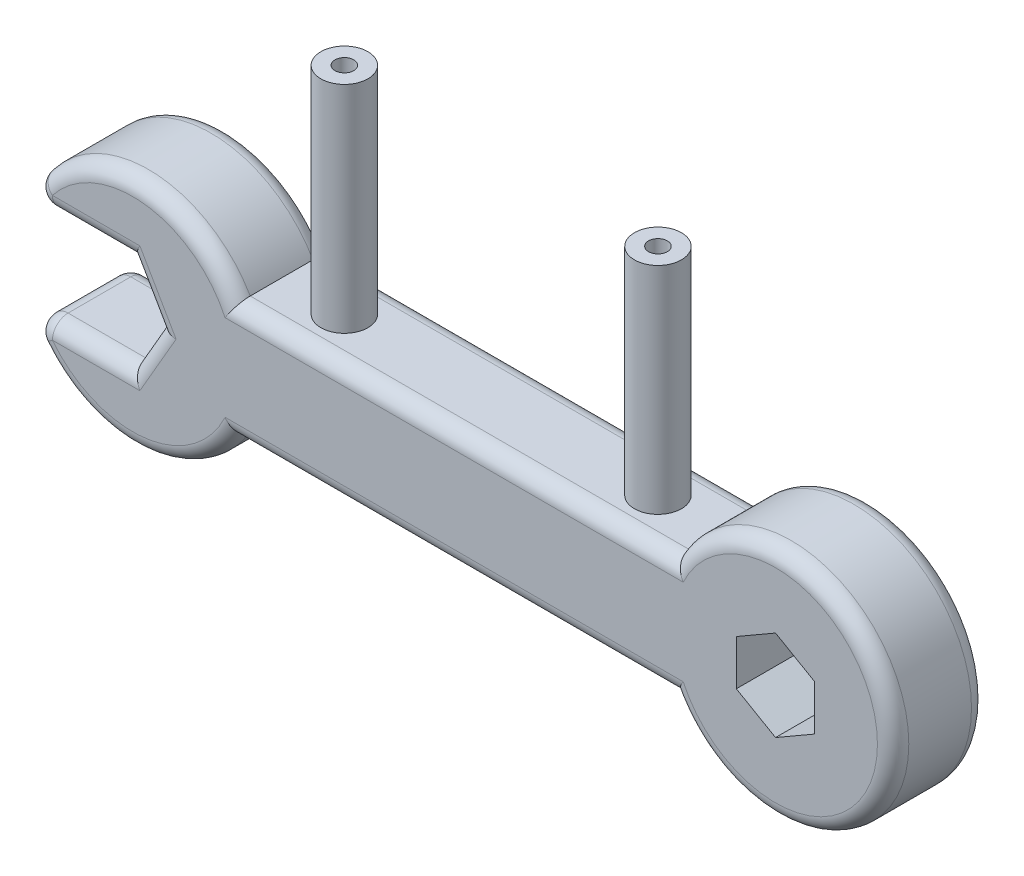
ISO-10303-21;
HEADER;
FILE_DESCRIPTION(('STEP AP214'),'2;1');
FILE_NAME('part.step','',(''),(''),'','','');
FILE_SCHEMA(('AUTOMOTIVE_DESIGN { 1 0 10303 214 1 1 1 1 }'));
ENDSEC;
DATA;
#1=APPLICATION_CONTEXT('core data for automotive mechanical design processes');
#2=APPLICATION_PROTOCOL_DEFINITION('international standard','automotive_design',2000,#1);
#3=PRODUCT_CONTEXT('',#1,'mechanical');
#4=PRODUCT('Part','Part','',(#3));
#5=PRODUCT_RELATED_PRODUCT_CATEGORY('part','',(#4));
#6=PRODUCT_DEFINITION_FORMATION('','',#4);
#7=PRODUCT_DEFINITION_CONTEXT('part definition',#1,'design');
#8=PRODUCT_DEFINITION('design','',#6,#7);
#9=PRODUCT_DEFINITION_SHAPE('','',#8);
#10=(LENGTH_UNIT() NAMED_UNIT(*) SI_UNIT(.MILLI.,.METRE.));
#11=(NAMED_UNIT(*) PLANE_ANGLE_UNIT() SI_UNIT($,.RADIAN.));
#12=(NAMED_UNIT(*) SI_UNIT($,.STERADIAN.) SOLID_ANGLE_UNIT());
#13=UNCERTAINTY_MEASURE_WITH_UNIT(LENGTH_MEASURE(1.E-05),#10,'distance_accuracy_value','');
#14=(GEOMETRIC_REPRESENTATION_CONTEXT(3) GLOBAL_UNCERTAINTY_ASSIGNED_CONTEXT((#13)) GLOBAL_UNIT_ASSIGNED_CONTEXT((#10,
#11,#12)) REPRESENTATION_CONTEXT('',''));
#15=CARTESIAN_POINT('',(0.,0.,0.));
#16=DIRECTION('',(0.,0.,1.));
#17=DIRECTION('',(1.,0.,0.));
#18=AXIS2_PLACEMENT_3D('',#15,#16,#17);
#19=CARTESIAN_POINT('',(-41.6676830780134,185.,-111.5));
#20=DIRECTION('',(0.,1.,0.));
#21=DIRECTION('',(0.,0.,-1.));
#22=AXIS2_PLACEMENT_3D('',#19,#20,#21);
#23=CYLINDRICAL_SURFACE('',#22,3.00000000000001);
#24=CARTESIAN_POINT('',(-41.6676830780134,185.,-111.5));
#25=DIRECTION('',(0.,-1.,0.));
#26=DIRECTION('',(0.,0.,1.));
#27=AXIS2_PLACEMENT_3D('',#24,#25,#26);
#28=CIRCLE('',#27,3.00000000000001);
#29=CARTESIAN_POINT('',(-41.6676830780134,185.,-108.5));
#30=VERTEX_POINT('',#29);
#31=EDGE_CURVE('E13',#30,#30,#28,.T.);
#32=ORIENTED_EDGE('',*,*,#31,.F.);
#33=EDGE_LOOP('',(#32));
#34=FACE_BOUND('',#33,.T.);
#35=CARTESIAN_POINT('',(-41.6676830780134,220.,-111.5));
#36=DIRECTION('',(0.,-1.,0.));
#37=DIRECTION('',(0.,0.,1.));
#38=AXIS2_PLACEMENT_3D('',#35,#36,#37);
#39=CIRCLE('',#38,3.00000000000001);
#40=CARTESIAN_POINT('',(-41.6676830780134,220.,-108.5));
#41=VERTEX_POINT('',#40);
#42=EDGE_CURVE('E57',#41,#41,#39,.T.);
#43=ORIENTED_EDGE('',*,*,#42,.T.);
#44=EDGE_LOOP('',(#43));
#45=FACE_BOUND('',#44,.T.);
#46=ADVANCED_FACE('F49',(#34,#45),#23,.T.);
#47=CARTESIAN_POINT('',(-41.6676830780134,185.,-111.5));
#48=DIRECTION('',(0.,-1.,0.));
#49=DIRECTION('',(0.,0.,1.));
#50=AXIS2_PLACEMENT_3D('',#47,#48,#49);
#51=PLANE('',#50);
#52=ORIENTED_EDGE('',*,*,#31,.T.);
#53=EDGE_LOOP('',(#52));
#54=FACE_BOUND('',#53,.T.);
#55=ADVANCED_FACE('F78',(#54),#51,.T.);
#56=CARTESIAN_POINT('',(-41.6676830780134,220.,-111.5));
#57=DIRECTION('',(0.,-1.,0.));
#58=DIRECTION('',(0.,0.,1.));
#59=AXIS2_PLACEMENT_3D('',#56,#57,#58);
#60=PLANE('',#59);
#61=CARTESIAN_POINT('',(-41.6676830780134,220.,-111.5));
#62=DIRECTION('',(0.,-1.,0.));
#63=DIRECTION('',(0.,0.,1.));
#64=AXIS2_PLACEMENT_3D('',#61,#62,#63);
#65=CIRCLE('',#64,1.19999999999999);
#66=CARTESIAN_POINT('',(-41.6676830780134,220.,-110.3));
#67=VERTEX_POINT('',#66);
#68=EDGE_CURVE('E67',#67,#67,#65,.T.);
#69=ORIENTED_EDGE('',*,*,#68,.T.);
#70=EDGE_LOOP('',(#69));
#71=FACE_BOUND('',#70,.T.);
#72=ORIENTED_EDGE('',*,*,#42,.F.);
#73=EDGE_LOOP('',(#72));
#74=FACE_BOUND('',#73,.T.);
#75=ADVANCED_FACE('F76',(#71,#74),#60,.F.);
#76=CARTESIAN_POINT('',(-41.6676830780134,229.,-111.5));
#77=DIRECTION('',(0.,1.,0.));
#78=DIRECTION('',(0.,0.,-1.));
#79=AXIS2_PLACEMENT_3D('',#76,#77,#78);
#80=CYLINDRICAL_SURFACE('',#79,1.19999999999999);
#81=CARTESIAN_POINT('',(-41.6676830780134,208.166633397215,-111.5));
#82=DIRECTION('',(0.,1.,0.));
#83=DIRECTION('',(0.,0.,1.));
#84=AXIS2_PLACEMENT_3D('',#81,#82,#83);
#85=CIRCLE('',#84,1.19999999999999);
#86=CARTESIAN_POINT('',(-41.6676830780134,208.166633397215,-110.3));
#87=VERTEX_POINT('',#86);
#88=EDGE_CURVE('E53',#87,#87,#85,.T.);
#89=ORIENTED_EDGE('',*,*,#88,.F.);
#90=EDGE_LOOP('',(#89));
#91=FACE_BOUND('',#90,.T.);
#92=ORIENTED_EDGE('',*,*,#68,.F.);
#93=EDGE_LOOP('',(#92));
#94=FACE_BOUND('',#93,.T.);
#95=ADVANCED_FACE('F63',(#91,#94),#80,.F.);
#96=CARTESIAN_POINT('',(-41.6676830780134,207.857167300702,-111.5));
#97=DIRECTION('',(0.,1.,0.));
#98=DIRECTION('',(0.,0.,-1.));
#99=AXIS2_PLACEMENT_3D('',#96,#97,#98);
#100=CONICAL_SURFACE('',#99,0.684961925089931,1.02974425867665);
#101=CARTESIAN_POINT('',(-41.6676830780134,207.445600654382,-111.5));
#102=VERTEX_POINT('',#101);
#103=VERTEX_LOOP('',#102);
#104=FACE_BOUND('',#103,.T.);
#105=ORIENTED_EDGE('',*,*,#88,.T.);
#106=EDGE_LOOP('',(#105));
#107=FACE_BOUND('',#106,.T.);
#108=ADVANCED_FACE('F51',(#104,#107),#100,.F.);
#109=CLOSED_SHELL('',(#46,#55,#75,#95,#108));
#110=MANIFOLD_SOLID_BREP('B2',#109);
#111=CARTESIAN_POINT('',(-112.914633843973,193.,-105.5));
#112=DIRECTION('',(0.,0.,-1.));
#113=DIRECTION('',(-1.,0.,0.));
#114=AXIS2_PLACEMENT_3D('',#111,#112,#113);
#115=PLANE('',#114);
#116=DIRECTION('',(-1.,0.,0.));
#117=VECTOR('',#116,1.);
#118=CARTESIAN_POINT('',(-112.914633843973,177.,-105.5));
#119=LINE('',#118,#117);
#120=CARTESIAN_POINT('',(-101.754248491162,177.,-105.5));
#121=VERTEX_POINT('',#120);
#122=CARTESIAN_POINT('',(-112.914633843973,177.,-105.5));
#123=VERTEX_POINT('',#122);
#124=EDGE_CURVE('E145',#121,#123,#119,.T.);
#125=ORIENTED_EDGE('',*,*,#124,.T.);
#126=CARTESIAN_POINT('',(-102.667683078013,185.,-105.5));
#127=DIRECTION('',(0.,0.,-1.));
#128=DIRECTION('',(-1.,0.,0.));
#129=AXIS2_PLACEMENT_3D('',#126,#127,#128);
#130=CIRCLE('',#129,13.);
#131=CARTESIAN_POINT('',(-90.8884640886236,179.5,-105.5));
#132=VERTEX_POINT('',#131);
#133=EDGE_CURVE('E47',#123,#132,#130,.F.);
#134=ORIENTED_EDGE('',*,*,#133,.T.);
#135=DIRECTION('',(1.,0.,0.));
#136=VECTOR('',#135,1.);
#137=CARTESIAN_POINT('',(-112.914633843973,179.5,-105.5));
#138=LINE('',#137,#136);
#139=CARTESIAN_POINT('',(-32.4469020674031,179.5,-105.5));
#140=VERTEX_POINT('',#139);
#141=EDGE_CURVE('E466',#132,#140,#138,.T.);
#142=ORIENTED_EDGE('',*,*,#141,.T.);
#143=CARTESIAN_POINT('',(-20.6676830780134,185.,-105.5));
#144=DIRECTION('',(0.,0.,-1.));
#145=DIRECTION('',(-1.,0.,0.));
#146=AXIS2_PLACEMENT_3D('',#143,#144,#145);
#147=CIRCLE('',#146,13.);
#148=CARTESIAN_POINT('',(-32.4469020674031,190.5,-105.5));
#149=VERTEX_POINT('',#148);
#150=EDGE_CURVE('E464',#140,#149,#147,.F.);
#151=ORIENTED_EDGE('',*,*,#150,.T.);
#152=DIRECTION('',(-1.,0.,0.));
#153=VECTOR('',#152,1.);
#154=CARTESIAN_POINT('',(-112.914633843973,190.5,-105.5));
#155=LINE('',#154,#153);
#156=CARTESIAN_POINT('',(-90.8884640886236,190.5,-105.5));
#157=VERTEX_POINT('',#156);
#158=EDGE_CURVE('E468',#149,#157,#155,.T.);
#159=ORIENTED_EDGE('',*,*,#158,.T.);
#160=CARTESIAN_POINT('',(-102.667683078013,185.,-105.5));
#161=DIRECTION('',(0.,0.,-1.));
#162=DIRECTION('',(-1.,0.,0.));
#163=AXIS2_PLACEMENT_3D('',#160,#161,#162);
#164=CIRCLE('',#163,13.);
#165=CARTESIAN_POINT('',(-112.914633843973,193.,-105.5));
#166=VERTEX_POINT('',#165);
#167=EDGE_CURVE('E470',#157,#166,#164,.F.);
#168=ORIENTED_EDGE('',*,*,#167,.T.);
#169=DIRECTION('',(1.,0.,0.));
#170=VECTOR('',#169,1.);
#171=CARTESIAN_POINT('',(-112.914633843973,193.,-105.5));
#172=LINE('',#171,#170);
#173=CARTESIAN_POINT('',(-101.754248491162,193.,-105.5));
#174=VERTEX_POINT('',#173);
#175=EDGE_CURVE('E472',#166,#174,#172,.T.);
#176=ORIENTED_EDGE('',*,*,#175,.T.);
#177=DIRECTION('',(0.5,-0.866025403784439,0.));
#178=VECTOR('',#177,1.);
#179=CARTESIAN_POINT('',(-104.544344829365,197.832588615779,-105.5));
#180=LINE('',#179,#178);
#181=CARTESIAN_POINT('',(-97.1354463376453,185.,-105.5));
#182=VERTEX_POINT('',#181);
#183=EDGE_CURVE('E474',#174,#182,#180,.T.);
#184=ORIENTED_EDGE('',*,*,#183,.T.);
#185=DIRECTION('',(-0.5,-0.866025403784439,0.));
#186=VECTOR('',#185,1.);
#187=CARTESIAN_POINT('',(-97.6161415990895,184.167411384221,-105.5));
#188=LINE('',#187,#186);
#189=EDGE_CURVE('E156',#182,#121,#188,.T.);
#190=ORIENTED_EDGE('',*,*,#189,.T.);
#191=EDGE_LOOP('',(#125,#134,#142,#151,#159,#168,#176,#184,#190));
#192=FACE_BOUND('',#191,.T.);
#193=DIRECTION('',(0.,1.,0.));
#194=VECTOR('',#193,1.);
#195=CARTESIAN_POINT('',(-15.6676830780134,182.113248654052,-105.5));
#196=LINE('',#195,#194);
#197=CARTESIAN_POINT('',(-15.6676830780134,182.113248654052,-105.5));
#198=VERTEX_POINT('',#197);
#199=CARTESIAN_POINT('',(-15.6676830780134,187.886751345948,-105.5));
#200=VERTEX_POINT('',#199);
#201=EDGE_CURVE('E309',#198,#200,#196,.T.);
#202=ORIENTED_EDGE('',*,*,#201,.F.);
#203=DIRECTION('',(0.866025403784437,0.500000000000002,0.));
#204=VECTOR('',#203,1.);
#205=CARTESIAN_POINT('',(-20.6676830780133,179.226497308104,-105.5));
#206=LINE('',#205,#204);
#207=CARTESIAN_POINT('',(-20.6676830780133,179.226497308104,-105.5));
#208=VERTEX_POINT('',#207);
#209=EDGE_CURVE('E342',#208,#198,#206,.T.);
#210=ORIENTED_EDGE('',*,*,#209,.F.);
#211=DIRECTION('',(0.866025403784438,-0.500000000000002,0.));
#212=VECTOR('',#211,1.);
#213=CARTESIAN_POINT('',(-25.6676830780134,182.113248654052,-105.5));
#214=LINE('',#213,#212);
#215=CARTESIAN_POINT('',(-25.6676830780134,182.113248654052,-105.5));
#216=VERTEX_POINT('',#215);
#217=EDGE_CURVE('E339',#216,#208,#214,.T.);
#218=ORIENTED_EDGE('',*,*,#217,.F.);
#219=DIRECTION('',(0.,-1.,0.));
#220=VECTOR('',#219,1.);
#221=CARTESIAN_POINT('',(-25.6676830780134,187.886751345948,-105.5));
#222=LINE('',#221,#220);
#223=CARTESIAN_POINT('',(-25.6676830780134,187.886751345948,-105.5));
#224=VERTEX_POINT('',#223);
#225=EDGE_CURVE('E334',#224,#216,#222,.T.);
#226=ORIENTED_EDGE('',*,*,#225,.F.);
#227=DIRECTION('',(-0.866025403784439,-0.499999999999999,0.));
#228=VECTOR('',#227,1.);
#229=CARTESIAN_POINT('',(-20.6676830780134,190.773502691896,-105.5));
#230=LINE('',#229,#228);
#231=CARTESIAN_POINT('',(-20.6676830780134,190.773502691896,-105.5));
#232=VERTEX_POINT('',#231);
#233=EDGE_CURVE('E332',#232,#224,#230,.T.);
#234=ORIENTED_EDGE('',*,*,#233,.F.);
#235=DIRECTION('',(-0.86602540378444,0.499999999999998,0.));
#236=VECTOR('',#235,1.);
#237=CARTESIAN_POINT('',(-15.6676830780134,187.886751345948,-105.5));
#238=LINE('',#237,#236);
#239=EDGE_CURVE('E319',#200,#232,#238,.T.);
#240=ORIENTED_EDGE('',*,*,#239,.F.);
#241=EDGE_LOOP('',(#202,#210,#218,#226,#234,#240));
#242=FACE_BOUND('',#241,.T.);
#243=ADVANCED_FACE('F130',(#192,#242),#115,.F.);
#244=CARTESIAN_POINT('',(-112.914633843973,193.,-117.5));
#245=DIRECTION('',(0.,0.,-1.));
#246=DIRECTION('',(-1.,0.,0.));
#247=AXIS2_PLACEMENT_3D('',#244,#245,#246);
#248=PLANE('',#247);
#249=CARTESIAN_POINT('',(-102.667683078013,185.,-117.5));
#250=DIRECTION('',(0.,0.,-1.));
#251=DIRECTION('',(-1.,0.,0.));
#252=AXIS2_PLACEMENT_3D('',#249,#250,#251);
#253=CIRCLE('',#252,13.);
#254=CARTESIAN_POINT('',(-90.8884640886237,179.5,-117.5));
#255=VERTEX_POINT('',#254);
#256=CARTESIAN_POINT('',(-112.914633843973,177.,-117.5));
#257=VERTEX_POINT('',#256);
#258=EDGE_CURVE('E418',#255,#257,#253,.T.);
#259=ORIENTED_EDGE('',*,*,#258,.T.);
#260=DIRECTION('',(-1.,0.,0.));
#261=VECTOR('',#260,1.);
#262=CARTESIAN_POINT('',(-102.908949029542,177.,-117.5));
#263=LINE('',#262,#261);
#264=CARTESIAN_POINT('',(-101.754248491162,177.,-117.5));
#265=VERTEX_POINT('',#264);
#266=EDGE_CURVE('E420',#257,#265,#263,.F.);
#267=ORIENTED_EDGE('',*,*,#266,.T.);
#268=DIRECTION('',(-0.5,-0.866025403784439,0.));
#269=VECTOR('',#268,1.);
#270=CARTESIAN_POINT('',(-97.712796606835,184.,-117.5));
#271=LINE('',#270,#269);
#272=CARTESIAN_POINT('',(-97.1354463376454,185.,-117.5));
#273=VERTEX_POINT('',#272);
#274=EDGE_CURVE('E404',#265,#273,#271,.F.);
#275=ORIENTED_EDGE('',*,*,#274,.T.);
#276=DIRECTION('',(0.5,-0.866025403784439,0.));
#277=VECTOR('',#276,1.);
#278=CARTESIAN_POINT('',(-101.176898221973,192.,-117.5));
#279=LINE('',#278,#277);
#280=CARTESIAN_POINT('',(-101.754248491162,193.,-117.5));
#281=VERTEX_POINT('',#280);
#282=EDGE_CURVE('E406',#273,#281,#279,.F.);
#283=ORIENTED_EDGE('',*,*,#282,.T.);
#284=DIRECTION('',(1.,0.,0.));
#285=VECTOR('',#284,1.);
#286=CARTESIAN_POINT('',(-112.914633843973,193.,-117.5));
#287=LINE('',#286,#285);
#288=CARTESIAN_POINT('',(-112.914633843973,193.,-117.5));
#289=VERTEX_POINT('',#288);
#290=EDGE_CURVE('E408',#281,#289,#287,.F.);
#291=ORIENTED_EDGE('',*,*,#290,.T.);
#292=CARTESIAN_POINT('',(-102.667683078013,185.,-117.5));
#293=DIRECTION('',(0.,0.,-1.));
#294=DIRECTION('',(-1.,0.,0.));
#295=AXIS2_PLACEMENT_3D('',#292,#293,#294);
#296=CIRCLE('',#295,13.);
#297=CARTESIAN_POINT('',(-90.8884640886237,190.5,-117.5));
#298=VERTEX_POINT('',#297);
#299=EDGE_CURVE('E410',#289,#298,#296,.T.);
#300=ORIENTED_EDGE('',*,*,#299,.T.);
#301=DIRECTION('',(-1.,0.,0.));
#302=VECTOR('',#301,1.);
#303=CARTESIAN_POINT('',(-33.65806413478,190.5,-117.5));
#304=LINE('',#303,#302);
#305=CARTESIAN_POINT('',(-32.4469020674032,190.5,-117.5));
#306=VERTEX_POINT('',#305);
#307=EDGE_CURVE('E412',#298,#306,#304,.F.);
#308=ORIENTED_EDGE('',*,*,#307,.T.);
#309=CARTESIAN_POINT('',(-20.6676830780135,185.,-117.5));
#310=DIRECTION('',(0.,0.,-1.));
#311=DIRECTION('',(-1.,0.,0.));
#312=AXIS2_PLACEMENT_3D('',#309,#310,#311);
#313=CIRCLE('',#312,13.);
#314=CARTESIAN_POINT('',(-32.4469020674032,179.5,-117.5));
#315=VERTEX_POINT('',#314);
#316=EDGE_CURVE('E414',#306,#315,#313,.T.);
#317=ORIENTED_EDGE('',*,*,#316,.T.);
#318=DIRECTION('',(1.,0.,0.));
#319=VECTOR('',#318,1.);
#320=CARTESIAN_POINT('',(-89.6773020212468,179.5,-117.5));
#321=LINE('',#320,#319);
#322=EDGE_CURVE('E416',#315,#255,#321,.F.);
#323=ORIENTED_EDGE('',*,*,#322,.T.);
#324=EDGE_LOOP('',(#259,#267,#275,#283,#291,#300,#308,#317,#323));
#325=FACE_BOUND('',#324,.T.);
#326=DIRECTION('',(0.866025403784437,0.500000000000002,0.));
#327=VECTOR('',#326,1.);
#328=CARTESIAN_POINT('',(-20.6676830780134,179.226497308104,-117.5));
#329=LINE('',#328,#327);
#330=CARTESIAN_POINT('',(-20.6676830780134,179.226497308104,-117.5));
#331=VERTEX_POINT('',#330);
#332=CARTESIAN_POINT('',(-15.6676830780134,182.113248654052,-117.5));
#333=VERTEX_POINT('',#332);
#334=EDGE_CURVE('E320',#331,#333,#329,.T.);
#335=ORIENTED_EDGE('',*,*,#334,.T.);
#336=DIRECTION('',(0.,1.,0.));
#337=VECTOR('',#336,1.);
#338=CARTESIAN_POINT('',(-15.6676830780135,182.113248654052,-117.5));
#339=LINE('',#338,#337);
#340=CARTESIAN_POINT('',(-15.6676830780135,187.886751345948,-117.5));
#341=VERTEX_POINT('',#340);
#342=EDGE_CURVE('E344',#333,#341,#339,.T.);
#343=ORIENTED_EDGE('',*,*,#342,.T.);
#344=DIRECTION('',(-0.86602540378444,0.499999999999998,0.));
#345=VECTOR('',#344,1.);
#346=CARTESIAN_POINT('',(-15.6676830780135,187.886751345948,-117.5));
#347=LINE('',#346,#345);
#348=CARTESIAN_POINT('',(-20.6676830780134,190.773502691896,-117.5));
#349=VERTEX_POINT('',#348);
#350=EDGE_CURVE('E326',#341,#349,#347,.T.);
#351=ORIENTED_EDGE('',*,*,#350,.T.);
#352=DIRECTION('',(-0.866025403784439,-0.499999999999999,0.));
#353=VECTOR('',#352,1.);
#354=CARTESIAN_POINT('',(-20.6676830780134,190.773502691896,-117.5));
#355=LINE('',#354,#353);
#356=CARTESIAN_POINT('',(-25.6676830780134,187.886751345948,-117.5));
#357=VERTEX_POINT('',#356);
#358=EDGE_CURVE('E348',#349,#357,#355,.T.);
#359=ORIENTED_EDGE('',*,*,#358,.T.);
#360=DIRECTION('',(0.,-1.,0.));
#361=VECTOR('',#360,1.);
#362=CARTESIAN_POINT('',(-25.6676830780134,187.886751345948,-117.5));
#363=LINE('',#362,#361);
#364=CARTESIAN_POINT('',(-25.6676830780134,182.113248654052,-117.5));
#365=VERTEX_POINT('',#364);
#366=EDGE_CURVE('E351',#357,#365,#363,.T.);
#367=ORIENTED_EDGE('',*,*,#366,.T.);
#368=DIRECTION('',(0.866025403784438,-0.500000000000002,0.));
#369=VECTOR('',#368,1.);
#370=CARTESIAN_POINT('',(-25.6676830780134,182.113248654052,-117.5));
#371=LINE('',#370,#369);
#372=EDGE_CURVE('E354',#365,#331,#371,.T.);
#373=ORIENTED_EDGE('',*,*,#372,.T.);
#374=EDGE_LOOP('',(#335,#343,#351,#359,#367,#373));
#375=FACE_BOUND('',#374,.T.);
#376=ADVANCED_FACE('F623',(#325,#375),#248,.T.);
#377=CARTESIAN_POINT('',(-102.908949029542,179.,-105.5));
#378=DIRECTION('',(0.866025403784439,-0.5,0.));
#379=DIRECTION('',(-0.5,-0.866025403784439,0.));
#380=AXIS2_PLACEMENT_3D('',#377,#378,#379);
#381=PLANE('',#380);
#382=DIRECTION('',(0.,0.,-1.));
#383=VECTOR('',#382,1.);
#384=CARTESIAN_POINT('',(-99.4448474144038,185.,-105.5));
#385=LINE('',#384,#383);
#386=CARTESIAN_POINT('',(-99.4448474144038,185.,-107.5));
#387=VERTEX_POINT('',#386);
#388=CARTESIAN_POINT('',(-99.4448474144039,185.,-115.5));
#389=VERTEX_POINT('',#388);
#390=EDGE_CURVE('E327',#387,#389,#385,.T.);
#391=ORIENTED_EDGE('',*,*,#390,.T.);
#392=DIRECTION('',(-0.5,-0.866025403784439,0.));
#393=VECTOR('',#392,1.);
#394=CARTESIAN_POINT('',(-102.908949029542,179.,-115.5));
#395=LINE('',#394,#393);
#396=CARTESIAN_POINT('',(-102.908949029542,179.,-115.5));
#397=VERTEX_POINT('',#396);
#398=EDGE_CURVE('E462',#389,#397,#395,.T.);
#399=ORIENTED_EDGE('',*,*,#398,.T.);
#400=DIRECTION('',(0.,0.,-1.));
#401=VECTOR('',#400,1.);
#402=CARTESIAN_POINT('',(-102.908949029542,179.,-105.5));
#403=LINE('',#402,#401);
#404=CARTESIAN_POINT('',(-102.908949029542,179.,-107.5));
#405=VERTEX_POINT('',#404);
#406=EDGE_CURVE('E396',#405,#397,#403,.T.);
#407=ORIENTED_EDGE('',*,*,#406,.F.);
#408=DIRECTION('',(-0.5,-0.866025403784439,0.));
#409=VECTOR('',#408,1.);
#410=CARTESIAN_POINT('',(-102.908949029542,179.,-107.5));
#411=LINE('',#410,#409);
#412=EDGE_CURVE('E460',#405,#387,#411,.F.);
#413=ORIENTED_EDGE('',*,*,#412,.T.);
#414=EDGE_LOOP('',(#391,#399,#407,#413));
#415=FACE_BOUND('',#414,.T.);
#416=ADVANCED_FACE('F628',(#415),#381,.F.);
#417=CARTESIAN_POINT('',(-112.914633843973,179.,-105.5));
#418=DIRECTION('',(0.,-1.,0.));
#419=DIRECTION('',(-1.,0.,0.));
#420=AXIS2_PLACEMENT_3D('',#417,#418,#419);
#421=PLANE('',#420);
#422=ORIENTED_EDGE('',*,*,#406,.T.);
#423=DIRECTION('',(-1.,0.,0.));
#424=VECTOR('',#423,1.);
#425=CARTESIAN_POINT('',(-112.914633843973,179.,-115.5));
#426=LINE('',#425,#424);
#427=CARTESIAN_POINT('',(-112.914633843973,179.,-115.5));
#428=VERTEX_POINT('',#427);
#429=EDGE_CURVE('E401',#397,#428,#426,.T.);
#430=ORIENTED_EDGE('',*,*,#429,.T.);
#431=DIRECTION('',(0.,0.,-1.));
#432=VECTOR('',#431,1.);
#433=CARTESIAN_POINT('',(-112.914633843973,179.,-105.5));
#434=LINE('',#433,#432);
#435=CARTESIAN_POINT('',(-112.914633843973,179.,-107.5));
#436=VERTEX_POINT('',#435);
#437=EDGE_CURVE('E393',#436,#428,#434,.T.);
#438=ORIENTED_EDGE('',*,*,#437,.F.);
#439=DIRECTION('',(-1.,0.,0.));
#440=VECTOR('',#439,1.);
#441=CARTESIAN_POINT('',(-112.914633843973,179.,-107.5));
#442=LINE('',#441,#440);
#443=EDGE_CURVE('E399',#436,#405,#442,.F.);
#444=ORIENTED_EDGE('',*,*,#443,.T.);
#445=EDGE_LOOP('',(#422,#430,#438,#444));
#446=FACE_BOUND('',#445,.T.);
#447=ADVANCED_FACE('F669',(#446),#421,.F.);
#448=CARTESIAN_POINT('',(-112.914633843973,177.,-105.5));
#449=DIRECTION('',(0.,0.,-1.));
#450=DIRECTION('',(-1.,0.,0.));
#451=AXIS2_PLACEMENT_3D('',#448,#449,#450);
#452=CYLINDRICAL_SURFACE('',#451,2.00000000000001);
#453=ORIENTED_EDGE('',*,*,#437,.T.);
#454=CARTESIAN_POINT('',(-112.914633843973,177.,-115.5));
#455=DIRECTION('',(0.,0.,-1.));
#456=DIRECTION('',(-1.,0.,0.));
#457=AXIS2_PLACEMENT_3D('',#454,#455,#456);
#458=CIRCLE('',#457,2.00000000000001);
#459=CARTESIAN_POINT('',(-114.491087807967,175.769230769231,-115.5));
#460=VERTEX_POINT('',#459);
#461=EDGE_CURVE('E425',#428,#460,#458,.F.);
#462=ORIENTED_EDGE('',*,*,#461,.T.);
#463=DIRECTION('',(0.,0.,-1.));
#464=VECTOR('',#463,1.);
#465=CARTESIAN_POINT('',(-114.491087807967,175.769230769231,-105.5));
#466=LINE('',#465,#464);
#467=CARTESIAN_POINT('',(-114.491087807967,175.769230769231,-107.5));
#468=VERTEX_POINT('',#467);
#469=EDGE_CURVE('E390',#468,#460,#466,.T.);
#470=ORIENTED_EDGE('',*,*,#469,.F.);
#471=CARTESIAN_POINT('',(-112.914633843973,177.,-107.5));
#472=DIRECTION('',(0.,0.,-1.));
#473=DIRECTION('',(-1.,0.,0.));
#474=AXIS2_PLACEMENT_3D('',#471,#472,#473);
#475=CIRCLE('',#474,2.00000000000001);
#476=EDGE_CURVE('E423',#468,#436,#475,.T.);
#477=ORIENTED_EDGE('',*,*,#476,.T.);
#478=EDGE_LOOP('',(#453,#462,#470,#477));
#479=FACE_BOUND('',#478,.T.);
#480=ADVANCED_FACE('F665',(#479),#452,.T.);
#481=CARTESIAN_POINT('',(-102.667683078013,185.,-105.5));
#482=DIRECTION('',(0.,0.,-1.));
#483=DIRECTION('',(-1.,0.,0.));
#484=AXIS2_PLACEMENT_3D('',#481,#482,#483);
#485=CYLINDRICAL_SURFACE('',#484,15.);
#486=ORIENTED_EDGE('',*,*,#469,.T.);
#487=CARTESIAN_POINT('',(-102.667683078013,185.,-115.5));
#488=DIRECTION('',(0.,0.,-1.));
#489=DIRECTION('',(-1.,0.,0.));
#490=AXIS2_PLACEMENT_3D('',#487,#488,#489);
#491=CIRCLE('',#490,15.);
#492=CARTESIAN_POINT('',(-89.6773020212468,177.5,-115.5));
#493=VERTEX_POINT('',#492);
#494=EDGE_CURVE('E429',#460,#493,#491,.F.);
#495=ORIENTED_EDGE('',*,*,#494,.T.);
#496=DIRECTION('',(0.,0.,-1.));
#497=VECTOR('',#496,1.);
#498=CARTESIAN_POINT('',(-89.6773020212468,177.5,-105.5));
#499=LINE('',#498,#497);
#500=CARTESIAN_POINT('',(-89.6773020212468,177.5,-107.5));
#501=VERTEX_POINT('',#500);
#502=EDGE_CURVE('E387',#501,#493,#499,.T.);
#503=ORIENTED_EDGE('',*,*,#502,.F.);
#504=CARTESIAN_POINT('',(-102.667683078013,185.,-107.5));
#505=DIRECTION('',(0.,0.,-1.));
#506=DIRECTION('',(-1.,0.,0.));
#507=AXIS2_PLACEMENT_3D('',#504,#505,#506);
#508=CIRCLE('',#507,15.);
#509=EDGE_CURVE('E427',#501,#468,#508,.T.);
#510=ORIENTED_EDGE('',*,*,#509,.T.);
#511=EDGE_LOOP('',(#486,#495,#503,#510));
#512=FACE_BOUND('',#511,.T.);
#513=ADVANCED_FACE('F661',(#512),#485,.T.);
#514=CARTESIAN_POINT('',(-89.6773020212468,177.5,-105.5));
#515=DIRECTION('',(0.,1.,0.));
#516=DIRECTION('',(1.,0.,0.));
#517=AXIS2_PLACEMENT_3D('',#514,#515,#516);
#518=PLANE('',#517);
#519=ORIENTED_EDGE('',*,*,#502,.T.);
#520=DIRECTION('',(1.,0.,0.));
#521=VECTOR('',#520,1.);
#522=CARTESIAN_POINT('',(-33.65806413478,177.5,-115.5));
#523=LINE('',#522,#521);
#524=CARTESIAN_POINT('',(-33.65806413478,177.5,-115.5));
#525=VERTEX_POINT('',#524);
#526=EDGE_CURVE('E433',#493,#525,#523,.T.);
#527=ORIENTED_EDGE('',*,*,#526,.T.);
#528=DIRECTION('',(0.,0.,-1.));
#529=VECTOR('',#528,1.);
#530=CARTESIAN_POINT('',(-33.65806413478,177.5,-105.5));
#531=LINE('',#530,#529);
#532=CARTESIAN_POINT('',(-33.65806413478,177.5,-107.5));
#533=VERTEX_POINT('',#532);
#534=EDGE_CURVE('E384',#533,#525,#531,.T.);
#535=ORIENTED_EDGE('',*,*,#534,.F.);
#536=DIRECTION('',(1.,0.,0.));
#537=VECTOR('',#536,1.);
#538=CARTESIAN_POINT('',(-89.6773020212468,177.5,-107.5));
#539=LINE('',#538,#537);
#540=EDGE_CURVE('E431',#533,#501,#539,.F.);
#541=ORIENTED_EDGE('',*,*,#540,.T.);
#542=EDGE_LOOP('',(#519,#527,#535,#541));
#543=FACE_BOUND('',#542,.T.);
#544=ADVANCED_FACE('F657',(#543),#518,.F.);
#545=CARTESIAN_POINT('',(-20.6676830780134,185.,-105.5));
#546=DIRECTION('',(0.,0.,-1.));
#547=DIRECTION('',(-1.,0.,0.));
#548=AXIS2_PLACEMENT_3D('',#545,#546,#547);
#549=CYLINDRICAL_SURFACE('',#548,15.);
#550=ORIENTED_EDGE('',*,*,#534,.T.);
#551=CARTESIAN_POINT('',(-20.6676830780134,185.,-115.5));
#552=DIRECTION('',(0.,0.,-1.));
#553=DIRECTION('',(-1.,0.,0.));
#554=AXIS2_PLACEMENT_3D('',#551,#552,#553);
#555=CIRCLE('',#554,15.);
#556=CARTESIAN_POINT('',(-33.65806413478,192.5,-115.5));
#557=VERTEX_POINT('',#556);
#558=EDGE_CURVE('E437',#525,#557,#555,.F.);
#559=ORIENTED_EDGE('',*,*,#558,.T.);
#560=DIRECTION('',(0.,0.,-1.));
#561=VECTOR('',#560,1.);
#562=CARTESIAN_POINT('',(-33.65806413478,192.5,-105.5));
#563=LINE('',#562,#561);
#564=CARTESIAN_POINT('',(-33.65806413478,192.5,-107.5));
#565=VERTEX_POINT('',#564);
#566=EDGE_CURVE('E381',#565,#557,#563,.T.);
#567=ORIENTED_EDGE('',*,*,#566,.F.);
#568=CARTESIAN_POINT('',(-20.6676830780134,185.,-107.5));
#569=DIRECTION('',(0.,0.,-1.));
#570=DIRECTION('',(-1.,0.,0.));
#571=AXIS2_PLACEMENT_3D('',#568,#569,#570);
#572=CIRCLE('',#571,15.);
#573=EDGE_CURVE('E435',#565,#533,#572,.T.);
#574=ORIENTED_EDGE('',*,*,#573,.T.);
#575=EDGE_LOOP('',(#550,#559,#567,#574));
#576=FACE_BOUND('',#575,.T.);
#577=ADVANCED_FACE('F653',(#576),#549,.T.);
#578=CARTESIAN_POINT('',(-89.6773020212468,192.5,-105.5));
#579=DIRECTION('',(0.,-1.,0.));
#580=DIRECTION('',(0.,0.,1.));
#581=AXIS2_PLACEMENT_3D('',#578,#579,#580);
#582=PLANE('',#581);
#583=CARTESIAN_POINT('',(-81.6676830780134,192.5,-111.5));
#584=DIRECTION('',(0.,1.,0.));
#585=DIRECTION('',(0.,0.,-1.));
#586=AXIS2_PLACEMENT_3D('',#583,#584,#585);
#587=CIRCLE('',#586,3.);
#588=CARTESIAN_POINT('',(-81.6676830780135,192.5,-114.5));
#589=VERTEX_POINT('',#588);
#590=EDGE_CURVE('E756',#589,#589,#587,.T.);
#591=ORIENTED_EDGE('',*,*,#590,.F.);
#592=EDGE_LOOP('',(#591));
#593=FACE_BOUND('',#592,.T.);
#594=CARTESIAN_POINT('',(-41.6676830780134,192.5,-111.5));
#595=DIRECTION('',(0.,1.,0.));
#596=DIRECTION('',(0.,0.,-1.));
#597=AXIS2_PLACEMENT_3D('',#594,#595,#596);
#598=CIRCLE('',#597,3.00000000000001);
#599=CARTESIAN_POINT('',(-41.6676830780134,192.5,-114.5));
#600=VERTEX_POINT('',#599);
#601=EDGE_CURVE('E765',#600,#600,#598,.T.);
#602=ORIENTED_EDGE('',*,*,#601,.F.);
#603=EDGE_LOOP('',(#602));
#604=FACE_BOUND('',#603,.T.);
#605=ORIENTED_EDGE('',*,*,#566,.T.);
#606=DIRECTION('',(-1.,0.,0.));
#607=VECTOR('',#606,1.);
#608=CARTESIAN_POINT('',(-89.6773020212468,192.5,-115.5));
#609=LINE('',#608,#607);
#610=CARTESIAN_POINT('',(-89.6773020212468,192.5,-115.5));
#611=VERTEX_POINT('',#610);
#612=EDGE_CURVE('E441',#557,#611,#609,.T.);
#613=ORIENTED_EDGE('',*,*,#612,.T.);
#614=DIRECTION('',(0.,0.,-1.));
#615=VECTOR('',#614,1.);
#616=CARTESIAN_POINT('',(-89.6773020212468,192.5,-105.5));
#617=LINE('',#616,#615);
#618=CARTESIAN_POINT('',(-89.6773020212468,192.5,-107.5));
#619=VERTEX_POINT('',#618);
#620=EDGE_CURVE('E378',#619,#611,#617,.T.);
#621=ORIENTED_EDGE('',*,*,#620,.F.);
#622=DIRECTION('',(-1.,0.,0.));
#623=VECTOR('',#622,1.);
#624=CARTESIAN_POINT('',(-89.6773020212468,192.5,-107.5));
#625=LINE('',#624,#623);
#626=EDGE_CURVE('E439',#619,#565,#625,.F.);
#627=ORIENTED_EDGE('',*,*,#626,.T.);
#628=EDGE_LOOP('',(#605,#613,#621,#627));
#629=FACE_BOUND('',#628,.T.);
#630=ADVANCED_FACE('F649',(#593,#604,#629),#582,.F.);
#631=CARTESIAN_POINT('',(-102.667683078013,185.,-105.5));
#632=DIRECTION('',(0.,0.,-1.));
#633=DIRECTION('',(-1.,0.,0.));
#634=AXIS2_PLACEMENT_3D('',#631,#632,#633);
#635=CYLINDRICAL_SURFACE('',#634,15.);
#636=ORIENTED_EDGE('',*,*,#620,.T.);
#637=CARTESIAN_POINT('',(-102.667683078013,185.,-115.5));
#638=DIRECTION('',(0.,0.,-1.));
#639=DIRECTION('',(-1.,0.,0.));
#640=AXIS2_PLACEMENT_3D('',#637,#638,#639);
#641=CIRCLE('',#640,15.);
#642=CARTESIAN_POINT('',(-114.491087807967,194.230769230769,-115.5));
#643=VERTEX_POINT('',#642);
#644=EDGE_CURVE('E445',#611,#643,#641,.F.);
#645=ORIENTED_EDGE('',*,*,#644,.T.);
#646=DIRECTION('',(0.,0.,-1.));
#647=VECTOR('',#646,1.);
#648=CARTESIAN_POINT('',(-114.491087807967,194.230769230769,-105.5));
#649=LINE('',#648,#647);
#650=CARTESIAN_POINT('',(-114.491087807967,194.230769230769,-107.5));
#651=VERTEX_POINT('',#650);
#652=EDGE_CURVE('E375',#651,#643,#649,.T.);
#653=ORIENTED_EDGE('',*,*,#652,.F.);
#654=CARTESIAN_POINT('',(-102.667683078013,185.,-107.5));
#655=DIRECTION('',(0.,0.,-1.));
#656=DIRECTION('',(-1.,0.,0.));
#657=AXIS2_PLACEMENT_3D('',#654,#655,#656);
#658=CIRCLE('',#657,15.);
#659=EDGE_CURVE('E443',#651,#619,#658,.T.);
#660=ORIENTED_EDGE('',*,*,#659,.T.);
#661=EDGE_LOOP('',(#636,#645,#653,#660));
#662=FACE_BOUND('',#661,.T.);
#663=ADVANCED_FACE('F645',(#662),#635,.T.);
#664=CARTESIAN_POINT('',(-112.914633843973,193.,-105.5));
#665=DIRECTION('',(0.,0.,-1.));
#666=DIRECTION('',(-1.,0.,0.));
#667=AXIS2_PLACEMENT_3D('',#664,#665,#666);
#668=CYLINDRICAL_SURFACE('',#667,1.99999999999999);
#669=ORIENTED_EDGE('',*,*,#652,.T.);
#670=CARTESIAN_POINT('',(-112.914633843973,193.,-115.5));
#671=DIRECTION('',(0.,0.,-1.));
#672=DIRECTION('',(-1.,0.,0.));
#673=AXIS2_PLACEMENT_3D('',#670,#671,#672);
#674=CIRCLE('',#673,1.99999999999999);
#675=CARTESIAN_POINT('',(-112.914633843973,191.,-115.5));
#676=VERTEX_POINT('',#675);
#677=EDGE_CURVE('E449',#643,#676,#674,.F.);
#678=ORIENTED_EDGE('',*,*,#677,.T.);
#679=DIRECTION('',(0.,0.,-1.));
#680=VECTOR('',#679,1.);
#681=CARTESIAN_POINT('',(-112.914633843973,191.,-105.5));
#682=LINE('',#681,#680);
#683=CARTESIAN_POINT('',(-112.914633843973,191.,-107.5));
#684=VERTEX_POINT('',#683);
#685=EDGE_CURVE('E372',#684,#676,#682,.T.);
#686=ORIENTED_EDGE('',*,*,#685,.F.);
#687=CARTESIAN_POINT('',(-112.914633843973,193.,-107.5));
#688=DIRECTION('',(0.,0.,-1.));
#689=DIRECTION('',(-1.,0.,0.));
#690=AXIS2_PLACEMENT_3D('',#687,#688,#689);
#691=CIRCLE('',#690,1.99999999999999);
#692=EDGE_CURVE('E447',#684,#651,#691,.T.);
#693=ORIENTED_EDGE('',*,*,#692,.T.);
#694=EDGE_LOOP('',(#669,#678,#686,#693));
#695=FACE_BOUND('',#694,.T.);
#696=ADVANCED_FACE('F641',(#695),#668,.T.);
#697=CARTESIAN_POINT('',(-102.908949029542,191.,-105.5));
#698=DIRECTION('',(0.,1.,0.));
#699=DIRECTION('',(0.,0.,-1.));
#700=AXIS2_PLACEMENT_3D('',#697,#698,#699);
#701=PLANE('',#700);
#702=ORIENTED_EDGE('',*,*,#685,.T.);
#703=DIRECTION('',(1.,0.,0.));
#704=VECTOR('',#703,1.);
#705=CARTESIAN_POINT('',(-102.908949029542,191.,-115.5));
#706=LINE('',#705,#704);
#707=CARTESIAN_POINT('',(-102.908949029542,191.,-115.5));
#708=VERTEX_POINT('',#707);
#709=EDGE_CURVE('E453',#676,#708,#706,.T.);
#710=ORIENTED_EDGE('',*,*,#709,.T.);
#711=DIRECTION('',(0.,0.,-1.));
#712=VECTOR('',#711,1.);
#713=CARTESIAN_POINT('',(-102.908949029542,191.,-105.5));
#714=LINE('',#713,#712);
#715=CARTESIAN_POINT('',(-102.908949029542,191.,-107.5));
#716=VERTEX_POINT('',#715);
#717=EDGE_CURVE('E369',#716,#708,#714,.T.);
#718=ORIENTED_EDGE('',*,*,#717,.F.);
#719=DIRECTION('',(1.,0.,0.));
#720=VECTOR('',#719,1.);
#721=CARTESIAN_POINT('',(-102.908949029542,191.,-107.5));
#722=LINE('',#721,#720);
#723=EDGE_CURVE('E451',#716,#684,#722,.F.);
#724=ORIENTED_EDGE('',*,*,#723,.T.);
#725=EDGE_LOOP('',(#702,#710,#718,#724));
#726=FACE_BOUND('',#725,.T.);
#727=ADVANCED_FACE('F637',(#726),#701,.F.);
#728=CARTESIAN_POINT('',(-99.4448474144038,185.,-105.5));
#729=DIRECTION('',(0.866025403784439,0.5,0.));
#730=DIRECTION('',(0.5,-0.866025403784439,0.));
#731=AXIS2_PLACEMENT_3D('',#728,#729,#730);
#732=PLANE('',#731);
#733=ORIENTED_EDGE('',*,*,#717,.T.);
#734=DIRECTION('',(0.5,-0.866025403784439,0.));
#735=VECTOR('',#734,1.);
#736=CARTESIAN_POINT('',(-99.4448474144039,185.,-115.5));
#737=LINE('',#736,#735);
#738=EDGE_CURVE('E458',#708,#389,#737,.T.);
#739=ORIENTED_EDGE('',*,*,#738,.T.);
#740=ORIENTED_EDGE('',*,*,#390,.F.);
#741=DIRECTION('',(0.5,-0.866025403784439,0.));
#742=VECTOR('',#741,1.);
#743=CARTESIAN_POINT('',(-99.4448474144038,185.,-107.5));
#744=LINE('',#743,#742);
#745=EDGE_CURVE('E455',#387,#716,#744,.F.);
#746=ORIENTED_EDGE('',*,*,#745,.T.);
#747=EDGE_LOOP('',(#733,#739,#740,#746));
#748=FACE_BOUND('',#747,.T.);
#749=ADVANCED_FACE('F634',(#748),#732,.F.);
#750=CARTESIAN_POINT('',(-15.6676830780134,182.113248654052,-105.5));
#751=DIRECTION('',(-1.,0.,0.));
#752=DIRECTION('',(0.,0.,1.));
#753=AXIS2_PLACEMENT_3D('',#750,#751,#752);
#754=PLANE('',#753);
#755=ORIENTED_EDGE('',*,*,#342,.F.);
#756=DIRECTION('',(0.,0.,-1.));
#757=VECTOR('',#756,1.);
#758=CARTESIAN_POINT('',(-15.6676830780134,182.113248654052,-105.5));
#759=LINE('',#758,#757);
#760=EDGE_CURVE('E315',#198,#333,#759,.T.);
#761=ORIENTED_EDGE('',*,*,#760,.F.);
#762=ORIENTED_EDGE('',*,*,#201,.T.);
#763=DIRECTION('',(0.,0.,-1.));
#764=VECTOR('',#763,1.);
#765=CARTESIAN_POINT('',(-15.6676830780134,187.886751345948,-105.5));
#766=LINE('',#765,#764);
#767=EDGE_CURVE('E312',#200,#341,#766,.T.);
#768=ORIENTED_EDGE('',*,*,#767,.T.);
#769=EDGE_LOOP('',(#755,#761,#762,#768));
#770=FACE_BOUND('',#769,.T.);
#771=ADVANCED_FACE('F311',(#770),#754,.T.);
#772=CARTESIAN_POINT('',(-15.6676830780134,187.886751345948,-105.5));
#773=DIRECTION('',(-0.499999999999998,-0.86602540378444,0.));
#774=DIRECTION('',(-0.86602540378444,0.499999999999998,0.));
#775=AXIS2_PLACEMENT_3D('',#772,#773,#774);
#776=PLANE('',#775);
#777=ORIENTED_EDGE('',*,*,#350,.F.);
#778=ORIENTED_EDGE('',*,*,#767,.F.);
#779=ORIENTED_EDGE('',*,*,#239,.T.);
#780=DIRECTION('',(0.,0.,-1.));
#781=VECTOR('',#780,1.);
#782=CARTESIAN_POINT('',(-20.6676830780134,190.773502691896,-105.5));
#783=LINE('',#782,#781);
#784=EDGE_CURVE('E328',#232,#349,#783,.T.);
#785=ORIENTED_EDGE('',*,*,#784,.T.);
#786=EDGE_LOOP('',(#777,#778,#779,#785));
#787=FACE_BOUND('',#786,.T.);
#788=ADVANCED_FACE('F323',(#787),#776,.T.);
#789=CARTESIAN_POINT('',(-20.6676830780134,190.773502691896,-105.5));
#790=DIRECTION('',(0.499999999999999,-0.866025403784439,0.));
#791=DIRECTION('',(-0.866025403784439,-0.499999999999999,0.));
#792=AXIS2_PLACEMENT_3D('',#789,#790,#791);
#793=PLANE('',#792);
#794=ORIENTED_EDGE('',*,*,#358,.F.);
#795=ORIENTED_EDGE('',*,*,#784,.F.);
#796=ORIENTED_EDGE('',*,*,#233,.T.);
#797=DIRECTION('',(0.,0.,-1.));
#798=VECTOR('',#797,1.);
#799=CARTESIAN_POINT('',(-25.6676830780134,187.886751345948,-105.5));
#800=LINE('',#799,#798);
#801=EDGE_CURVE('E364',#224,#357,#800,.T.);
#802=ORIENTED_EDGE('',*,*,#801,.T.);
#803=EDGE_LOOP('',(#794,#795,#796,#802));
#804=FACE_BOUND('',#803,.T.);
#805=ADVANCED_FACE('F902',(#804),#793,.T.);
#806=CARTESIAN_POINT('',(-25.6676830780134,187.886751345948,-105.5));
#807=DIRECTION('',(1.,0.,0.));
#808=DIRECTION('',(0.,0.,-1.));
#809=AXIS2_PLACEMENT_3D('',#806,#807,#808);
#810=PLANE('',#809);
#811=ORIENTED_EDGE('',*,*,#366,.F.);
#812=ORIENTED_EDGE('',*,*,#801,.F.);
#813=ORIENTED_EDGE('',*,*,#225,.T.);
#814=DIRECTION('',(0.,0.,-1.));
#815=VECTOR('',#814,1.);
#816=CARTESIAN_POINT('',(-25.6676830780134,182.113248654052,-105.5));
#817=LINE('',#816,#815);
#818=EDGE_CURVE('E362',#216,#365,#817,.T.);
#819=ORIENTED_EDGE('',*,*,#818,.T.);
#820=EDGE_LOOP('',(#811,#812,#813,#819));
#821=FACE_BOUND('',#820,.T.);
#822=ADVANCED_FACE('F892',(#821),#810,.T.);
#823=CARTESIAN_POINT('',(-25.6676830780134,182.113248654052,-105.5));
#824=DIRECTION('',(0.500000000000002,0.866025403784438,0.));
#825=DIRECTION('',(0.866025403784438,-0.500000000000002,0.));
#826=AXIS2_PLACEMENT_3D('',#823,#824,#825);
#827=PLANE('',#826);
#828=ORIENTED_EDGE('',*,*,#372,.F.);
#829=ORIENTED_EDGE('',*,*,#818,.F.);
#830=ORIENTED_EDGE('',*,*,#217,.T.);
#831=DIRECTION('',(0.,0.,-1.));
#832=VECTOR('',#831,1.);
#833=CARTESIAN_POINT('',(-20.6676830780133,179.226497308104,-105.5));
#834=LINE('',#833,#832);
#835=EDGE_CURVE('E360',#208,#331,#834,.T.);
#836=ORIENTED_EDGE('',*,*,#835,.T.);
#837=EDGE_LOOP('',(#828,#829,#830,#836));
#838=FACE_BOUND('',#837,.T.);
#839=ADVANCED_FACE('F882',(#838),#827,.T.);
#840=CARTESIAN_POINT('',(-20.6676830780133,179.226497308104,-105.5));
#841=DIRECTION('',(-0.500000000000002,0.866025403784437,0.));
#842=DIRECTION('',(0.866025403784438,0.500000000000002,0.));
#843=AXIS2_PLACEMENT_3D('',#840,#841,#842);
#844=PLANE('',#843);
#845=ORIENTED_EDGE('',*,*,#334,.F.);
#846=ORIENTED_EDGE('',*,*,#835,.F.);
#847=ORIENTED_EDGE('',*,*,#209,.T.);
#848=ORIENTED_EDGE('',*,*,#760,.T.);
#849=EDGE_LOOP('',(#845,#846,#847,#848));
#850=FACE_BOUND('',#849,.T.);
#851=ADVANCED_FACE('F556',(#850),#844,.T.);
#852=CARTESIAN_POINT('',(-102.667683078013,185.,-115.5));
#853=DIRECTION('',(0.,0.,-1.));
#854=DIRECTION('',(-1.,0.,0.));
#855=AXIS2_PLACEMENT_3D('',#852,#853,#854);
#856=TOROIDAL_SURFACE('',#855,13.,2.);
#857=CARTESIAN_POINT('',(-112.914633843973,193.,-115.5));
#858=DIRECTION('',(-0.615384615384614,-0.788226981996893,0.));
#859=DIRECTION('',(-0.788226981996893,0.615384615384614,0.));
#860=AXIS2_PLACEMENT_3D('',#857,#858,#859);
#861=CIRCLE('',#860,2.);
#862=EDGE_CURVE('E535',#643,#289,#861,.T.);
#863=ORIENTED_EDGE('',*,*,#862,.F.);
#864=ORIENTED_EDGE('',*,*,#644,.F.);
#865=CARTESIAN_POINT('',(-89.6773020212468,192.5,-115.5));
#866=CARTESIAN_POINT('',(-89.6772976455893,192.500008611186,-115.55075594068));
#867=CARTESIAN_POINT('',(-89.6784174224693,192.498068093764,-115.60150711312));
#868=CARTESIAN_POINT('',(-89.6828715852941,192.490354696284,-115.702604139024));
#869=CARTESIAN_POINT('',(-89.6862052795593,192.484583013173,-115.752950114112));
#870=CARTESIAN_POINT('',(-89.6950356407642,192.469304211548,-115.852670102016));
#871=CARTESIAN_POINT('',(-89.700523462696,192.459812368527,-115.902047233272));
#872=CARTESIAN_POINT('',(-89.713594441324,192.437224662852,-115.999674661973));
#873=CARTESIAN_POINT('',(-89.7211776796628,192.424128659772,-116.047924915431));
#874=CARTESIAN_POINT('',(-89.7469432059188,192.379681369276,-116.190408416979));
#875=CARTESIAN_POINT('',(-89.7681567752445,192.343143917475,-116.28254592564));
#876=CARTESIAN_POINT('',(-89.8178174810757,192.257895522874,-116.45886585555));
#877=CARTESIAN_POINT('',(-89.8462701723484,192.209175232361,-116.543042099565));
#878=CARTESIAN_POINT('',(-89.9109842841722,192.098817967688,-116.70578033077));
#879=CARTESIAN_POINT('',(-89.9475590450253,192.036666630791,-116.783867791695));
#880=CARTESIAN_POINT('',(-90.0264518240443,191.903278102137,-116.928460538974));
#881=CARTESIAN_POINT('',(-90.0687711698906,191.832038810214,-116.994963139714));
#882=CARTESIAN_POINT('',(-90.1637187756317,191.673106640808,-117.123432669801));
#883=CARTESIAN_POINT('',(-90.2169740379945,191.584471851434,-117.183768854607));
#884=CARTESIAN_POINT('',(-90.3280455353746,191.400904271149,-117.288734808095));
#885=CARTESIAN_POINT('',(-90.3858669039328,191.305964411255,-117.333346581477));
#886=CARTESIAN_POINT('',(-90.5150853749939,191.095384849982,-117.413190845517));
#887=CARTESIAN_POINT('',(-90.5871006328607,190.979005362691,-117.445465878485));
#888=CARTESIAN_POINT('',(-90.7337490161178,190.744228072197,-117.488607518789));
#889=CARTESIAN_POINT('',(-90.8083766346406,190.625834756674,-117.499516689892));
#890=CARTESIAN_POINT('',(-90.8850999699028,190.505284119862,-117.499994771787));
#891=CARTESIAN_POINT('',(-90.8867819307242,190.502641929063,-117.500000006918));
#892=CARTESIAN_POINT('',(-90.8884640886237,190.5,-117.5));
#893=B_SPLINE_CURVE_WITH_KNOTS('',3,(#865,#866,#867,#868,#869,#870,#871,#872,#873,#874,#875,
#876,#877,#878,#879,#880,#881,#882,#883,#884,#885,#886,#887,#888,#889,#890,#891,#892),
.UNSPECIFIED.,.F.,.F.,(4,2,2,2,2,2,2,2,2,2,2,2,2,4),(0.,0.152210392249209,0.304373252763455,
0.455917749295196,0.607468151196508,0.910052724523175,1.21287018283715,1.53046710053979,
1.84813754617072,2.20588597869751,2.56404250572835,2.98415514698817,3.40343001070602,
3.41282635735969),.UNSPECIFIED.);
#894=EDGE_CURVE('E346',#298,#611,#893,.F.);
#895=ORIENTED_EDGE('',*,*,#894,.F.);
#896=ORIENTED_EDGE('',*,*,#299,.F.);
#897=EDGE_LOOP('',(#863,#864,#895,#896));
#898=FACE_BOUND('',#897,.T.);
#899=ADVANCED_FACE('F541',(#898),#856,.T.);
#900=CARTESIAN_POINT('',(-89.6773020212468,190.5,-115.5));
#901=DIRECTION('',(1.,0.,0.));
#902=DIRECTION('',(0.,0.,-1.));
#903=AXIS2_PLACEMENT_3D('',#900,#901,#902);
#904=CYLINDRICAL_SURFACE('',#903,2.);
#905=ORIENTED_EDGE('',*,*,#894,.T.);
#906=ORIENTED_EDGE('',*,*,#612,.F.);
#907=CARTESIAN_POINT('',(-33.65806413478,192.5,-115.5));
#908=CARTESIAN_POINT('',(-33.6580685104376,192.500008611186,-115.55075594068));
#909=CARTESIAN_POINT('',(-33.6569487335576,192.498068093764,-115.60150711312));
#910=CARTESIAN_POINT('',(-33.6524945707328,192.490354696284,-115.702604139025));
#911=CARTESIAN_POINT('',(-33.6491608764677,192.484583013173,-115.752950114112));
#912=CARTESIAN_POINT('',(-33.6403305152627,192.469304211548,-115.852670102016));
#913=CARTESIAN_POINT('',(-33.6348426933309,192.459812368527,-115.902047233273));
#914=CARTESIAN_POINT('',(-33.6217717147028,192.437224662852,-115.999674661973));
#915=CARTESIAN_POINT('',(-33.6141884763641,192.424128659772,-116.047924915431));
#916=CARTESIAN_POINT('',(-33.5884229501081,192.379681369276,-116.190408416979));
#917=CARTESIAN_POINT('',(-33.5672093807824,192.343143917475,-116.282545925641));
#918=CARTESIAN_POINT('',(-33.5175486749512,192.257895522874,-116.45886585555));
#919=CARTESIAN_POINT('',(-33.4890959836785,192.209175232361,-116.543042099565));
#920=CARTESIAN_POINT('',(-33.4243818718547,192.098817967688,-116.70578033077));
#921=CARTESIAN_POINT('',(-33.3878071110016,192.036666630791,-116.783867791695));
#922=CARTESIAN_POINT('',(-33.3089143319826,191.903278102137,-116.928460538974));
#923=CARTESIAN_POINT('',(-33.2665949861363,191.832038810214,-116.994963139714));
#924=CARTESIAN_POINT('',(-33.1716473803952,191.673106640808,-117.123432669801));
#925=CARTESIAN_POINT('',(-33.1183921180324,191.584471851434,-117.183768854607));
#926=CARTESIAN_POINT('',(-33.0073206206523,191.400904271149,-117.288734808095));
#927=CARTESIAN_POINT('',(-32.9494992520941,191.305964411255,-117.333346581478));
#928=CARTESIAN_POINT('',(-32.8202807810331,191.095384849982,-117.413190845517));
#929=CARTESIAN_POINT('',(-32.7482655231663,190.979005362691,-117.445465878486));
#930=CARTESIAN_POINT('',(-32.6016171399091,190.744228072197,-117.488607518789));
#931=CARTESIAN_POINT('',(-32.5269895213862,190.625834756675,-117.499516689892));
#932=CARTESIAN_POINT('',(-32.4502661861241,190.505284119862,-117.499994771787));
#933=CARTESIAN_POINT('',(-32.4485842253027,190.502641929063,-117.500000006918));
#934=CARTESIAN_POINT('',(-32.4469020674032,190.5,-117.5));
#935=B_SPLINE_CURVE_WITH_KNOTS('',3,(#907,#908,#909,#910,#911,#912,#913,#914,#915,#916,#917,
#918,#919,#920,#921,#922,#923,#924,#925,#926,#927,#928,#929,#930,#931,#932,#933,#934),
.UNSPECIFIED.,.F.,.F.,(4,2,2,2,2,2,2,2,2,2,2,2,2,4),(0.,0.152210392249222,0.304373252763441,
0.455917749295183,0.607468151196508,0.91005272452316,1.21287018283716,1.5304671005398,
1.84813754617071,2.2058859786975,2.56404250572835,2.98415514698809,3.40343001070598,
3.41282635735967),.UNSPECIFIED.);
#936=EDGE_CURVE('E528',#306,#557,#935,.F.);
#937=ORIENTED_EDGE('',*,*,#936,.F.);
#938=ORIENTED_EDGE('',*,*,#307,.F.);
#939=EDGE_LOOP('',(#905,#906,#937,#938));
#940=FACE_BOUND('',#939,.T.);
#941=ADVANCED_FACE('F537',(#940),#904,.T.);
#942=CARTESIAN_POINT('',(-112.914633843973,193.,-115.5));
#943=DIRECTION('',(0.,0.,-1.));
#944=DIRECTION('',(-1.,0.,0.));
#945=AXIS2_PLACEMENT_3D('',#942,#943,#944);
#946=SPHERICAL_SURFACE('',#945,2.);
#947=ORIENTED_EDGE('',*,*,#677,.F.);
#948=ORIENTED_EDGE('',*,*,#862,.T.);
#949=CARTESIAN_POINT('',(-112.914633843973,193.,-115.5));
#950=DIRECTION('',(1.,0.,0.));
#951=DIRECTION('',(0.,0.,-1.));
#952=AXIS2_PLACEMENT_3D('',#949,#950,#951);
#953=CIRCLE('',#952,2.);
#954=EDGE_CURVE('E518',#676,#289,#953,.T.);
#955=ORIENTED_EDGE('',*,*,#954,.F.);
#956=EDGE_LOOP('',(#947,#948,#955));
#957=FACE_BOUND('',#956,.T.);
#958=ADVANCED_FACE('F524',(#957),#946,.T.);
#959=CARTESIAN_POINT('',(-20.6676830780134,185.,-115.5));
#960=DIRECTION('',(0.,0.,-1.));
#961=DIRECTION('',(-1.,0.,0.));
#962=AXIS2_PLACEMENT_3D('',#959,#960,#961);
#963=TOROIDAL_SURFACE('',#962,13.,2.);
#964=ORIENTED_EDGE('',*,*,#936,.T.);
#965=ORIENTED_EDGE('',*,*,#558,.F.);
#966=CARTESIAN_POINT('',(-33.65806413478,177.5,-115.5));
#967=CARTESIAN_POINT('',(-33.6580685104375,177.499991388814,-115.55075594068));
#968=CARTESIAN_POINT('',(-33.6569487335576,177.501931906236,-115.60150711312));
#969=CARTESIAN_POINT('',(-33.6524945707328,177.509645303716,-115.702604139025));
#970=CARTESIAN_POINT('',(-33.6491608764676,177.515416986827,-115.752950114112));
#971=CARTESIAN_POINT('',(-33.6403305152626,177.530695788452,-115.852670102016));
#972=CARTESIAN_POINT('',(-33.6348426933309,177.540187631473,-115.902047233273));
#973=CARTESIAN_POINT('',(-33.6217717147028,177.562775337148,-115.999674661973));
#974=CARTESIAN_POINT('',(-33.614188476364,177.575871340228,-116.047924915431));
#975=CARTESIAN_POINT('',(-33.5884229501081,177.620318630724,-116.190408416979));
#976=CARTESIAN_POINT('',(-33.5672093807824,177.656856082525,-116.282545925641));
#977=CARTESIAN_POINT('',(-33.5175486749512,177.742104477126,-116.45886585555));
#978=CARTESIAN_POINT('',(-33.4890959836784,177.790824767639,-116.543042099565));
#979=CARTESIAN_POINT('',(-33.4243818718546,177.901182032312,-116.70578033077));
#980=CARTESIAN_POINT('',(-33.3878071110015,177.963333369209,-116.783867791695));
#981=CARTESIAN_POINT('',(-33.3089143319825,178.096721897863,-116.928460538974));
#982=CARTESIAN_POINT('',(-33.2665949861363,178.167961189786,-116.994963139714));
#983=CARTESIAN_POINT('',(-33.1716473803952,178.326893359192,-117.123432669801));
#984=CARTESIAN_POINT('',(-33.1183921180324,178.415528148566,-117.183768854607));
#985=CARTESIAN_POINT('',(-33.0073206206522,178.599095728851,-117.288734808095));
#986=CARTESIAN_POINT('',(-32.949499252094,178.694035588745,-117.333346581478));
#987=CARTESIAN_POINT('',(-32.820280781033,178.904615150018,-117.413190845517));
#988=CARTESIAN_POINT('',(-32.7482655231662,179.020994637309,-117.445465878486));
#989=CARTESIAN_POINT('',(-32.6016171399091,179.255771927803,-117.488607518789));
#990=CARTESIAN_POINT('',(-32.5269895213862,179.374165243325,-117.499516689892));
#991=CARTESIAN_POINT('',(-32.4502661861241,179.494715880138,-117.499994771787));
#992=CARTESIAN_POINT('',(-32.4485842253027,179.497358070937,-117.500000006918));
#993=CARTESIAN_POINT('',(-32.4469020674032,179.5,-117.5));
#994=B_SPLINE_CURVE_WITH_KNOTS('',3,(#966,#967,#968,#969,#970,#971,#972,#973,#974,#975,#976,
#977,#978,#979,#980,#981,#982,#983,#984,#985,#986,#987,#988,#989,#990,#991,#992,#993),
.UNSPECIFIED.,.F.,.F.,(4,2,2,2,2,2,2,2,2,2,2,2,2,4),(0.,0.152210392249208,0.304373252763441,
0.455917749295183,0.60746815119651,0.910052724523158,1.21287018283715,1.53046710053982,
1.8481375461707,2.20588597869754,2.56404250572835,2.98415514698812,3.40343001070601,
3.41282635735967),.UNSPECIFIED.);
#995=EDGE_CURVE('E511',#315,#525,#994,.F.);
#996=ORIENTED_EDGE('',*,*,#995,.F.);
#997=ORIENTED_EDGE('',*,*,#316,.F.);
#998=EDGE_LOOP('',(#964,#965,#996,#997));
#999=FACE_BOUND('',#998,.T.);
#1000=ADVANCED_FACE('F520',(#999),#963,.T.);
#1001=CARTESIAN_POINT('',(-102.908949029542,193.,-115.5));
#1002=DIRECTION('',(-1.,0.,0.));
#1003=DIRECTION('',(0.,0.,1.));
#1004=AXIS2_PLACEMENT_3D('',#1001,#1002,#1003);
#1005=CYLINDRICAL_SURFACE('',#1004,2.);
#1006=ORIENTED_EDGE('',*,*,#954,.T.);
#1007=ORIENTED_EDGE('',*,*,#290,.F.);
#1008=CARTESIAN_POINT('',(-101.754248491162,193.,-115.5));
#1009=DIRECTION('',(-0.866025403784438,0.5,0.));
#1010=DIRECTION('',(-0.5,-0.866025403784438,0.));
#1011=AXIS2_PLACEMENT_3D('',#1008,#1009,#1010);
#1012=ELLIPSE('',#1011,2.3094010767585,2.);
#1013=EDGE_CURVE('E497',#708,#281,#1012,.F.);
#1014=ORIENTED_EDGE('',*,*,#1013,.F.);
#1015=ORIENTED_EDGE('',*,*,#709,.F.);
#1016=EDGE_LOOP('',(#1006,#1007,#1014,#1015));
#1017=FACE_BOUND('',#1016,.T.);
#1018=ADVANCED_FACE('F507',(#1017),#1005,.T.);
#1019=CARTESIAN_POINT('',(-89.6773020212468,179.5,-115.5));
#1020=DIRECTION('',(-1.,0.,0.));
#1021=DIRECTION('',(0.,1.,0.));
#1022=AXIS2_PLACEMENT_3D('',#1019,#1020,#1021);
#1023=CYLINDRICAL_SURFACE('',#1022,2.);
#1024=ORIENTED_EDGE('',*,*,#995,.T.);
#1025=ORIENTED_EDGE('',*,*,#526,.F.);
#1026=CARTESIAN_POINT('',(-89.6773020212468,177.5,-115.5));
#1027=CARTESIAN_POINT('',(-89.6772976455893,177.499991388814,-115.55075594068));
#1028=CARTESIAN_POINT('',(-89.6784174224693,177.501931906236,-115.60150711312));
#1029=CARTESIAN_POINT('',(-89.682871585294,177.509645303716,-115.702604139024));
#1030=CARTESIAN_POINT('',(-89.6862052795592,177.515416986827,-115.752950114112));
#1031=CARTESIAN_POINT('',(-89.6950356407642,177.530695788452,-115.852670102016));
#1032=CARTESIAN_POINT('',(-89.7005234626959,177.540187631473,-115.902047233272));
#1033=CARTESIAN_POINT('',(-89.713594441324,177.562775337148,-115.999674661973));
#1034=CARTESIAN_POINT('',(-89.7211776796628,177.575871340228,-116.047924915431));
#1035=CARTESIAN_POINT('',(-89.7469432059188,177.620318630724,-116.190408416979));
#1036=CARTESIAN_POINT('',(-89.7681567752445,177.656856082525,-116.28254592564));
#1037=CARTESIAN_POINT('',(-89.8178174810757,177.742104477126,-116.45886585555));
#1038=CARTESIAN_POINT('',(-89.8462701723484,177.790824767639,-116.543042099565));
#1039=CARTESIAN_POINT('',(-89.9109842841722,177.901182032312,-116.70578033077));
#1040=CARTESIAN_POINT('',(-89.9475590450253,177.963333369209,-116.783867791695));
#1041=CARTESIAN_POINT('',(-90.0264518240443,178.096721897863,-116.928460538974));
#1042=CARTESIAN_POINT('',(-90.0687711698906,178.167961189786,-116.994963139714));
#1043=CARTESIAN_POINT('',(-90.1637187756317,178.326893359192,-117.123432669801));
#1044=CARTESIAN_POINT('',(-90.2169740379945,178.415528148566,-117.183768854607));
#1045=CARTESIAN_POINT('',(-90.3280455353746,178.599095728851,-117.288734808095));
#1046=CARTESIAN_POINT('',(-90.3858669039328,178.694035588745,-117.333346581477));
#1047=CARTESIAN_POINT('',(-90.5150853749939,178.904615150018,-117.413190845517));
#1048=CARTESIAN_POINT('',(-90.5871006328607,179.020994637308,-117.445465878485));
#1049=CARTESIAN_POINT('',(-90.7337490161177,179.255771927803,-117.488607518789));
#1050=CARTESIAN_POINT('',(-90.8083766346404,179.374165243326,-117.499516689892));
#1051=CARTESIAN_POINT('',(-90.8850999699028,179.494715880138,-117.499994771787));
#1052=CARTESIAN_POINT('',(-90.8867819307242,179.497358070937,-117.500000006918));
#1053=CARTESIAN_POINT('',(-90.8884640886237,179.5,-117.5));
#1054=B_SPLINE_CURVE_WITH_KNOTS('',3,(#1026,#1027,#1028,#1029,#1030,#1031,#1032,#1033,#1034,
#1035,#1036,#1037,#1038,#1039,#1040,#1041,#1042,#1043,#1044,#1045,#1046,#1047,#1048,#1049,#1050,
#1051,#1052,#1053),.UNSPECIFIED.,.F.,.F.,(4,2,2,2,2,2,2,2,2,2,2,2,2,4),(0.,0.152210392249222,
0.304373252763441,0.455917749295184,0.607468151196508,0.91005272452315,1.21287018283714,
1.53046710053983,1.84813754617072,2.20588597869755,2.56404250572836,2.98415514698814,
3.40343001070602,3.41282635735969),.UNSPECIFIED.);
#1055=EDGE_CURVE('E488',#255,#493,#1054,.F.);
#1056=ORIENTED_EDGE('',*,*,#1055,.F.);
#1057=ORIENTED_EDGE('',*,*,#322,.F.);
#1058=EDGE_LOOP('',(#1024,#1025,#1056,#1057));
#1059=FACE_BOUND('',#1058,.T.);
#1060=ADVANCED_FACE('F502',(#1059),#1023,.T.);
#1061=CARTESIAN_POINT('',(-97.712796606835,186.,-115.5));
#1062=DIRECTION('',(-0.5,0.866025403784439,0.));
#1063=DIRECTION('',(0.866025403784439,0.5,0.));
#1064=AXIS2_PLACEMENT_3D('',#1061,#1062,#1063);
#1065=CYLINDRICAL_SURFACE('',#1064,2.);
#1066=ORIENTED_EDGE('',*,*,#1013,.T.);
#1067=ORIENTED_EDGE('',*,*,#282,.F.);
#1068=CARTESIAN_POINT('',(-97.1354463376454,185.,-115.5));
#1069=DIRECTION('',(0.,1.,0.));
#1070=DIRECTION('',(-1.,0.,0.));
#1071=AXIS2_PLACEMENT_3D('',#1068,#1069,#1070);
#1072=ELLIPSE('',#1071,2.3094010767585,2.);
#1073=EDGE_CURVE('E485',#389,#273,#1072,.F.);
#1074=ORIENTED_EDGE('',*,*,#1073,.F.);
#1075=ORIENTED_EDGE('',*,*,#738,.F.);
#1076=EDGE_LOOP('',(#1066,#1067,#1074,#1075));
#1077=FACE_BOUND('',#1076,.T.);
#1078=ADVANCED_FACE('F506',(#1077),#1065,.T.);
#1079=CARTESIAN_POINT('',(-102.667683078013,185.,-115.5));
#1080=DIRECTION('',(0.,0.,-1.));
#1081=DIRECTION('',(-1.,0.,0.));
#1082=AXIS2_PLACEMENT_3D('',#1079,#1080,#1081);
#1083=TOROIDAL_SURFACE('',#1082,13.,2.);
#1084=ORIENTED_EDGE('',*,*,#1055,.T.);
#1085=ORIENTED_EDGE('',*,*,#494,.F.);
#1086=CARTESIAN_POINT('',(-112.914633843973,177.,-115.5));
#1087=DIRECTION('',(-0.615384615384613,0.788226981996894,0.));
#1088=DIRECTION('',(0.788226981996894,0.615384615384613,0.));
#1089=AXIS2_PLACEMENT_3D('',#1086,#1087,#1088);
#1090=CIRCLE('',#1089,2.);
#1091=EDGE_CURVE('E482',#257,#460,#1090,.T.);
#1092=ORIENTED_EDGE('',*,*,#1091,.F.);
#1093=ORIENTED_EDGE('',*,*,#258,.F.);
#1094=EDGE_LOOP('',(#1084,#1085,#1092,#1093));
#1095=FACE_BOUND('',#1094,.T.);
#1096=ADVANCED_FACE('F499',(#1095),#1083,.T.);
#1097=CARTESIAN_POINT('',(-101.176898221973,178.,-115.5));
#1098=DIRECTION('',(0.5,0.866025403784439,0.));
#1099=DIRECTION('',(0.866025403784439,-0.5,0.));
#1100=AXIS2_PLACEMENT_3D('',#1097,#1098,#1099);
#1101=CYLINDRICAL_SURFACE('',#1100,2.);
#1102=ORIENTED_EDGE('',*,*,#1073,.T.);
#1103=ORIENTED_EDGE('',*,*,#274,.F.);
#1104=CARTESIAN_POINT('',(-101.754248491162,177.,-115.5));
#1105=DIRECTION('',(0.866025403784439,0.499999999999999,0.));
#1106=DIRECTION('',(0.499999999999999,-0.866025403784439,0.));
#1107=AXIS2_PLACEMENT_3D('',#1104,#1105,#1106);
#1108=ELLIPSE('',#1107,2.3094010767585,2.);
#1109=EDGE_CURVE('E480',#397,#265,#1108,.F.);
#1110=ORIENTED_EDGE('',*,*,#1109,.F.);
#1111=ORIENTED_EDGE('',*,*,#398,.F.);
#1112=EDGE_LOOP('',(#1102,#1103,#1110,#1111));
#1113=FACE_BOUND('',#1112,.T.);
#1114=ADVANCED_FACE('F683',(#1113),#1101,.T.);
#1115=CARTESIAN_POINT('',(-112.914633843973,177.,-115.5));
#1116=DIRECTION('',(0.,0.,-1.));
#1117=DIRECTION('',(-1.,0.,0.));
#1118=AXIS2_PLACEMENT_3D('',#1115,#1116,#1117);
#1119=SPHERICAL_SURFACE('',#1118,2.);
#1120=ORIENTED_EDGE('',*,*,#1091,.T.);
#1121=ORIENTED_EDGE('',*,*,#461,.F.);
#1122=CARTESIAN_POINT('',(-112.914633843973,177.,-115.5));
#1123=DIRECTION('',(1.,0.,0.));
#1124=DIRECTION('',(0.,0.,-1.));
#1125=AXIS2_PLACEMENT_3D('',#1122,#1123,#1124);
#1126=CIRCLE('',#1125,2.);
#1127=EDGE_CURVE('E478',#257,#428,#1126,.T.);
#1128=ORIENTED_EDGE('',*,*,#1127,.F.);
#1129=EDGE_LOOP('',(#1120,#1121,#1128));
#1130=FACE_BOUND('',#1129,.T.);
#1131=ADVANCED_FACE('F680',(#1130),#1119,.T.);
#1132=CARTESIAN_POINT('',(-112.914633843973,177.,-115.5));
#1133=DIRECTION('',(1.,0.,0.));
#1134=DIRECTION('',(0.,-1.,0.));
#1135=AXIS2_PLACEMENT_3D('',#1132,#1133,#1134);
#1136=CYLINDRICAL_SURFACE('',#1135,2.);
#1137=ORIENTED_EDGE('',*,*,#1109,.T.);
#1138=ORIENTED_EDGE('',*,*,#266,.F.);
#1139=ORIENTED_EDGE('',*,*,#1127,.T.);
#1140=ORIENTED_EDGE('',*,*,#429,.F.);
#1141=EDGE_LOOP('',(#1137,#1138,#1139,#1140));
#1142=FACE_BOUND('',#1141,.T.);
#1143=ADVANCED_FACE('F677',(#1142),#1136,.T.);
#1144=CARTESIAN_POINT('',(-20.6676830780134,185.,-107.5));
#1145=DIRECTION('',(0.,0.,-1.));
#1146=DIRECTION('',(-1.,0.,0.));
#1147=AXIS2_PLACEMENT_3D('',#1144,#1145,#1146);
#1148=TOROIDAL_SURFACE('',#1147,13.,2.);
#1149=CARTESIAN_POINT('',(-33.65806413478,192.5,-107.5));
#1150=CARTESIAN_POINT('',(-33.6580685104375,192.500008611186,-107.44924405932));
#1151=CARTESIAN_POINT('',(-33.6569487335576,192.498068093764,-107.39849288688));
#1152=CARTESIAN_POINT('',(-33.6524945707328,192.490354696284,-107.297395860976));
#1153=CARTESIAN_POINT('',(-33.6491608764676,192.484583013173,-107.247049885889));
#1154=CARTESIAN_POINT('',(-33.6403305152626,192.469304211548,-107.147329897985));
#1155=CARTESIAN_POINT('',(-33.6348426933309,192.459812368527,-107.097952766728));
#1156=CARTESIAN_POINT('',(-33.6217717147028,192.437224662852,-107.000325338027));
#1157=CARTESIAN_POINT('',(-33.614188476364,192.424128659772,-106.952075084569));
#1158=CARTESIAN_POINT('',(-33.588422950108,192.379681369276,-106.809591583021));
#1159=CARTESIAN_POINT('',(-33.5672093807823,192.343143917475,-106.71745407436));
#1160=CARTESIAN_POINT('',(-33.5175486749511,192.257895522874,-106.54113414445));
#1161=CARTESIAN_POINT('',(-33.4890959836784,192.209175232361,-106.456957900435));
#1162=CARTESIAN_POINT('',(-33.4243818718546,192.098817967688,-106.29421966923));
#1163=CARTESIAN_POINT('',(-33.3878071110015,192.036666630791,-106.216132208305));
#1164=CARTESIAN_POINT('',(-33.3089143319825,191.903278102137,-106.071539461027));
#1165=CARTESIAN_POINT('',(-33.2665949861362,191.832038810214,-106.005036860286));
#1166=CARTESIAN_POINT('',(-33.1716473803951,191.673106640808,-105.876567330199));
#1167=CARTESIAN_POINT('',(-33.1183921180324,191.584471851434,-105.816231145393));
#1168=CARTESIAN_POINT('',(-33.0073206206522,191.400904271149,-105.711265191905));
#1169=CARTESIAN_POINT('',(-32.949499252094,191.305964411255,-105.666653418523));
#1170=CARTESIAN_POINT('',(-32.820280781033,191.095384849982,-105.586809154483));
#1171=CARTESIAN_POINT('',(-32.7482655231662,190.979005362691,-105.554534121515));
#1172=CARTESIAN_POINT('',(-32.601617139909,190.744228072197,-105.511392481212));
#1173=CARTESIAN_POINT('',(-32.5269895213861,190.625834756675,-105.500483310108));
#1174=CARTESIAN_POINT('',(-32.450266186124,190.505284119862,-105.500005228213));
#1175=CARTESIAN_POINT('',(-32.4485842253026,190.502641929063,-105.499999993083));
#1176=CARTESIAN_POINT('',(-32.4469020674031,190.5,-105.5));
#1177=B_SPLINE_CURVE_WITH_KNOTS('',3,(#1149,#1150,#1151,#1152,#1153,#1154,#1155,#1156,#1157,
#1158,#1159,#1160,#1161,#1162,#1163,#1164,#1165,#1166,#1167,#1168,#1169,#1170,#1171,#1172,#1173,
#1174,#1175,#1176),.UNSPECIFIED.,.F.,.F.,(4,2,2,2,2,2,2,2,2,2,2,2,2,4),(0.,0.152210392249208,
0.304373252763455,0.455917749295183,0.607468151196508,0.910052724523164,1.21287018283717,
1.53046710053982,1.84813754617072,2.20588597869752,2.56404250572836,2.98415514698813,
3.403430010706,3.41282635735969),.UNSPECIFIED.);
#1178=EDGE_CURVE('E608',#149,#565,#1177,.F.);
#1179=ORIENTED_EDGE('',*,*,#1178,.F.);
#1180=ORIENTED_EDGE('',*,*,#150,.F.);
#1181=CARTESIAN_POINT('',(-33.65806413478,177.5,-107.5));
#1182=CARTESIAN_POINT('',(-33.6580685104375,177.499991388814,-107.44924405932));
#1183=CARTESIAN_POINT('',(-33.6569487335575,177.501931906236,-107.39849288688));
#1184=CARTESIAN_POINT('',(-33.6524945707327,177.509645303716,-107.297395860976));
#1185=CARTESIAN_POINT('',(-33.6491608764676,177.515416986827,-107.247049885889));
#1186=CARTESIAN_POINT('',(-33.6403305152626,177.530695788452,-107.147329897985));
#1187=CARTESIAN_POINT('',(-33.6348426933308,177.540187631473,-107.097952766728));
#1188=CARTESIAN_POINT('',(-33.6217717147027,177.562775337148,-107.000325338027));
#1189=CARTESIAN_POINT('',(-33.614188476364,177.575871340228,-106.952075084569));
#1190=CARTESIAN_POINT('',(-33.588422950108,177.620318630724,-106.809591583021));
#1191=CARTESIAN_POINT('',(-33.5672093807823,177.656856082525,-106.71745407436));
#1192=CARTESIAN_POINT('',(-33.5175486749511,177.742104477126,-106.54113414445));
#1193=CARTESIAN_POINT('',(-33.4890959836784,177.790824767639,-106.456957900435));
#1194=CARTESIAN_POINT('',(-33.4243818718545,177.901182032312,-106.29421966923));
#1195=CARTESIAN_POINT('',(-33.3878071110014,177.963333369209,-106.216132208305));
#1196=CARTESIAN_POINT('',(-33.3089143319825,178.096721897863,-106.071539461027));
#1197=CARTESIAN_POINT('',(-33.2665949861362,178.167961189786,-106.005036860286));
#1198=CARTESIAN_POINT('',(-33.1716473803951,178.326893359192,-105.876567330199));
#1199=CARTESIAN_POINT('',(-33.1183921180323,178.415528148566,-105.816231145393));
#1200=CARTESIAN_POINT('',(-33.0073206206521,178.599095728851,-105.711265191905));
#1201=CARTESIAN_POINT('',(-32.9494992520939,178.694035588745,-105.666653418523));
#1202=CARTESIAN_POINT('',(-32.8202807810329,178.904615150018,-105.586809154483));
#1203=CARTESIAN_POINT('',(-32.7482655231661,179.020994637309,-105.554534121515));
#1204=CARTESIAN_POINT('',(-32.601617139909,179.255771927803,-105.511392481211));
#1205=CARTESIAN_POINT('',(-32.526989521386,179.374165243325,-105.500483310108));
#1206=CARTESIAN_POINT('',(-32.450266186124,179.494715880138,-105.500005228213));
#1207=CARTESIAN_POINT('',(-32.4485842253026,179.497358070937,-105.499999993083));
#1208=CARTESIAN_POINT('',(-32.4469020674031,179.5,-105.5));
#1209=B_SPLINE_CURVE_WITH_KNOTS('',3,(#1181,#1182,#1183,#1184,#1185,#1186,#1187,#1188,#1189,
#1190,#1191,#1192,#1193,#1194,#1195,#1196,#1197,#1198,#1199,#1200,#1201,#1202,#1203,#1204,#1205,
#1206,#1207,#1208),.UNSPECIFIED.,.F.,.F.,(4,2,2,2,2,2,2,2,2,2,2,2,2,4),(0.,0.152210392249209,
0.304373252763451,0.455917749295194,0.607468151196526,0.910052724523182,1.21287018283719,
1.53046710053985,1.84813754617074,2.20588597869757,2.56404250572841,2.98415514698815,
3.40343001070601,3.4128263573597),.UNSPECIFIED.);
#1210=EDGE_CURVE('E135',#533,#140,#1209,.T.);
#1211=ORIENTED_EDGE('',*,*,#1210,.F.);
#1212=ORIENTED_EDGE('',*,*,#573,.F.);
#1213=EDGE_LOOP('',(#1179,#1180,#1211,#1212));
#1214=FACE_BOUND('',#1213,.T.);
#1215=ADVANCED_FACE('F132',(#1214),#1148,.T.);
#1216=CARTESIAN_POINT('',(-112.914633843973,179.5,-107.5));
#1217=DIRECTION('',(1.,0.,0.));
#1218=DIRECTION('',(0.,-1.,0.));
#1219=AXIS2_PLACEMENT_3D('',#1216,#1217,#1218);
#1220=CYLINDRICAL_SURFACE('',#1219,2.);
#1221=ORIENTED_EDGE('',*,*,#1210,.T.);
#1222=ORIENTED_EDGE('',*,*,#141,.F.);
#1223=CARTESIAN_POINT('',(-89.6773020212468,177.5,-107.5));
#1224=CARTESIAN_POINT('',(-89.6772976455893,177.499991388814,-107.44924405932));
#1225=CARTESIAN_POINT('',(-89.6784174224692,177.501931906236,-107.39849288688));
#1226=CARTESIAN_POINT('',(-89.682871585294,177.509645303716,-107.297395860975));
#1227=CARTESIAN_POINT('',(-89.6862052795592,177.515416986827,-107.247049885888));
#1228=CARTESIAN_POINT('',(-89.6950356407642,177.530695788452,-107.147329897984));
#1229=CARTESIAN_POINT('',(-89.7005234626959,177.540187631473,-107.097952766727));
#1230=CARTESIAN_POINT('',(-89.713594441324,177.562775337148,-107.000325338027));
#1231=CARTESIAN_POINT('',(-89.7211776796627,177.575871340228,-106.952075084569));
#1232=CARTESIAN_POINT('',(-89.7469432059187,177.620318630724,-106.809591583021));
#1233=CARTESIAN_POINT('',(-89.7681567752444,177.656856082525,-106.717454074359));
#1234=CARTESIAN_POINT('',(-89.8178174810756,177.742104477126,-106.54113414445));
#1235=CARTESIAN_POINT('',(-89.8462701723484,177.790824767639,-106.456957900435));
#1236=CARTESIAN_POINT('',(-89.9109842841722,177.901182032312,-106.29421966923));
#1237=CARTESIAN_POINT('',(-89.9475590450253,177.963333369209,-106.216132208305));
#1238=CARTESIAN_POINT('',(-90.0264518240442,178.096721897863,-106.071539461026));
#1239=CARTESIAN_POINT('',(-90.0687711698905,178.167961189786,-106.005036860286));
#1240=CARTESIAN_POINT('',(-90.1637187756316,178.326893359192,-105.876567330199));
#1241=CARTESIAN_POINT('',(-90.2169740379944,178.415528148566,-105.816231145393));
#1242=CARTESIAN_POINT('',(-90.3280455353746,178.599095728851,-105.711265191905));
#1243=CARTESIAN_POINT('',(-90.3858669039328,178.694035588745,-105.666653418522));
#1244=CARTESIAN_POINT('',(-90.5150853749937,178.904615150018,-105.586809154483));
#1245=CARTESIAN_POINT('',(-90.5871006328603,179.020994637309,-105.554534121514));
#1246=CARTESIAN_POINT('',(-90.7337490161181,179.255771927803,-105.511392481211));
#1247=CARTESIAN_POINT('',(-90.8083766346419,179.374165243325,-105.500483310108));
#1248=CARTESIAN_POINT('',(-90.8850999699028,179.494715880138,-105.500005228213));
#1249=CARTESIAN_POINT('',(-90.8867819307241,179.497358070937,-105.499999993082));
#1250=CARTESIAN_POINT('',(-90.8884640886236,179.5,-105.5));
#1251=B_SPLINE_CURVE_WITH_KNOTS('',3,(#1223,#1224,#1225,#1226,#1227,#1228,#1229,#1230,#1231,
#1232,#1233,#1234,#1235,#1236,#1237,#1238,#1239,#1240,#1241,#1242,#1243,#1244,#1245,#1246,#1247,
#1248,#1249,#1250),.UNSPECIFIED.,.F.,.F.,(4,2,2,2,2,2,2,2,2,2,2,2,2,4),(0.,0.152210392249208,
0.304373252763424,0.455917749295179,0.607468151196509,0.910052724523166,1.21287018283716,
1.53046710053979,1.84813754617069,2.20588597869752,2.56404250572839,2.98415514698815,
3.40343001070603,3.41282635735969),.UNSPECIFIED.);
#1252=EDGE_CURVE('E600',#501,#132,#1251,.T.);
#1253=ORIENTED_EDGE('',*,*,#1252,.F.);
#1254=ORIENTED_EDGE('',*,*,#540,.F.);
#1255=EDGE_LOOP('',(#1221,#1222,#1253,#1254));
#1256=FACE_BOUND('',#1255,.T.);
#1257=ADVANCED_FACE('F613',(#1256),#1220,.T.);
#1258=CARTESIAN_POINT('',(-112.914633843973,190.5,-107.5));
#1259=DIRECTION('',(-1.,0.,0.));
#1260=DIRECTION('',(0.,0.,1.));
#1261=AXIS2_PLACEMENT_3D('',#1258,#1259,#1260);
#1262=CYLINDRICAL_SURFACE('',#1261,2.);
#1263=ORIENTED_EDGE('',*,*,#1178,.T.);
#1264=ORIENTED_EDGE('',*,*,#626,.F.);
#1265=CARTESIAN_POINT('',(-89.6773020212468,192.5,-107.5));
#1266=CARTESIAN_POINT('',(-89.6772976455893,192.500008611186,-107.44924405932));
#1267=CARTESIAN_POINT('',(-89.6784174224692,192.498068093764,-107.39849288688));
#1268=CARTESIAN_POINT('',(-89.682871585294,192.490354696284,-107.297395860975));
#1269=CARTESIAN_POINT('',(-89.6862052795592,192.484583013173,-107.247049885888));
#1270=CARTESIAN_POINT('',(-89.6950356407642,192.469304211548,-107.147329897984));
#1271=CARTESIAN_POINT('',(-89.7005234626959,192.459812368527,-107.097952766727));
#1272=CARTESIAN_POINT('',(-89.713594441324,192.437224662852,-107.000325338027));
#1273=CARTESIAN_POINT('',(-89.7211776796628,192.424128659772,-106.952075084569));
#1274=CARTESIAN_POINT('',(-89.7469432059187,192.379681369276,-106.809591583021));
#1275=CARTESIAN_POINT('',(-89.7681567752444,192.343143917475,-106.717454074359));
#1276=CARTESIAN_POINT('',(-89.8178174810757,192.257895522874,-106.54113414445));
#1277=CARTESIAN_POINT('',(-89.8462701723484,192.209175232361,-106.456957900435));
#1278=CARTESIAN_POINT('',(-89.9109842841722,192.098817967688,-106.29421966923));
#1279=CARTESIAN_POINT('',(-89.9475590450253,192.036666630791,-106.216132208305));
#1280=CARTESIAN_POINT('',(-90.0264518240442,191.903278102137,-106.071539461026));
#1281=CARTESIAN_POINT('',(-90.0687711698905,191.832038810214,-106.005036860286));
#1282=CARTESIAN_POINT('',(-90.1637187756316,191.673106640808,-105.876567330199));
#1283=CARTESIAN_POINT('',(-90.2169740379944,191.584471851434,-105.816231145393));
#1284=CARTESIAN_POINT('',(-90.3280455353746,191.400904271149,-105.711265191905));
#1285=CARTESIAN_POINT('',(-90.3858669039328,191.305964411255,-105.666653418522));
#1286=CARTESIAN_POINT('',(-90.5150853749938,191.095384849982,-105.586809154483));
#1287=CARTESIAN_POINT('',(-90.5871006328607,190.979005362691,-105.554534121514));
#1288=CARTESIAN_POINT('',(-90.7337490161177,190.744228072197,-105.511392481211));
#1289=CARTESIAN_POINT('',(-90.8083766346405,190.625834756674,-105.500483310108));
#1290=CARTESIAN_POINT('',(-90.8850999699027,190.505284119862,-105.500005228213));
#1291=CARTESIAN_POINT('',(-90.8867819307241,190.502641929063,-105.499999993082));
#1292=CARTESIAN_POINT('',(-90.8884640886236,190.5,-105.5));
#1293=B_SPLINE_CURVE_WITH_KNOTS('',3,(#1265,#1266,#1267,#1268,#1269,#1270,#1271,#1272,#1273,
#1274,#1275,#1276,#1277,#1278,#1279,#1280,#1281,#1282,#1283,#1284,#1285,#1286,#1287,#1288,#1289,
#1290,#1291,#1292),.UNSPECIFIED.,.F.,.F.,(4,2,2,2,2,2,2,2,2,2,2,2,2,4),(0.,0.152210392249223,
0.304373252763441,0.455917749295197,0.607468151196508,0.910052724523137,1.21287018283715,
1.53046710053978,1.84813754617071,2.20588597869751,2.56404250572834,2.98415514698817,
3.40343001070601,3.41282635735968),.UNSPECIFIED.);
#1294=EDGE_CURVE('E592',#157,#619,#1293,.F.);
#1295=ORIENTED_EDGE('',*,*,#1294,.F.);
#1296=ORIENTED_EDGE('',*,*,#158,.F.);
#1297=EDGE_LOOP('',(#1263,#1264,#1295,#1296));
#1298=FACE_BOUND('',#1297,.T.);
#1299=ADVANCED_FACE('F589',(#1298),#1262,.T.);
#1300=CARTESIAN_POINT('',(-102.667683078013,185.,-107.5));
#1301=DIRECTION('',(0.,0.,-1.));
#1302=DIRECTION('',(-1.,0.,0.));
#1303=AXIS2_PLACEMENT_3D('',#1300,#1301,#1302);
#1304=TOROIDAL_SURFACE('',#1303,13.,2.);
#1305=ORIENTED_EDGE('',*,*,#1252,.T.);
#1306=ORIENTED_EDGE('',*,*,#133,.F.);
#1307=CARTESIAN_POINT('',(-112.914633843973,177.,-107.5));
#1308=DIRECTION('',(-0.615384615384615,0.788226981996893,0.));
#1309=DIRECTION('',(0.788226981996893,0.615384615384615,0.));
#1310=AXIS2_PLACEMENT_3D('',#1307,#1308,#1309);
#1311=CIRCLE('',#1310,2.);
#1312=EDGE_CURVE('E601',#468,#123,#1311,.T.);
#1313=ORIENTED_EDGE('',*,*,#1312,.F.);
#1314=ORIENTED_EDGE('',*,*,#509,.F.);
#1315=EDGE_LOOP('',(#1305,#1306,#1313,#1314));
#1316=FACE_BOUND('',#1315,.T.);
#1317=ADVANCED_FACE('F587',(#1316),#1304,.T.);
#1318=CARTESIAN_POINT('',(-102.667683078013,185.,-107.5));
#1319=DIRECTION('',(0.,0.,-1.));
#1320=DIRECTION('',(-1.,0.,0.));
#1321=AXIS2_PLACEMENT_3D('',#1318,#1319,#1320);
#1322=TOROIDAL_SURFACE('',#1321,13.,2.);
#1323=ORIENTED_EDGE('',*,*,#1294,.T.);
#1324=ORIENTED_EDGE('',*,*,#659,.F.);
#1325=CARTESIAN_POINT('',(-112.914633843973,193.,-107.5));
#1326=DIRECTION('',(-0.615384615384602,-0.788226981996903,0.));
#1327=DIRECTION('',(-0.788226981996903,0.615384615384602,0.));
#1328=AXIS2_PLACEMENT_3D('',#1325,#1326,#1327);
#1329=CIRCLE('',#1328,2.);
#1330=EDGE_CURVE('E739',#166,#651,#1329,.T.);
#1331=ORIENTED_EDGE('',*,*,#1330,.F.);
#1332=ORIENTED_EDGE('',*,*,#167,.F.);
#1333=EDGE_LOOP('',(#1323,#1324,#1331,#1332));
#1334=FACE_BOUND('',#1333,.T.);
#1335=ADVANCED_FACE('F582',(#1334),#1322,.T.);
#1336=CARTESIAN_POINT('',(-112.914633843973,177.,-107.5));
#1337=DIRECTION('',(0.,0.,-1.));
#1338=DIRECTION('',(-1.,0.,0.));
#1339=AXIS2_PLACEMENT_3D('',#1336,#1337,#1338);
#1340=SPHERICAL_SURFACE('',#1339,2.);
#1341=ORIENTED_EDGE('',*,*,#476,.F.);
#1342=ORIENTED_EDGE('',*,*,#1312,.T.);
#1343=CARTESIAN_POINT('',(-112.914633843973,177.,-107.5));
#1344=DIRECTION('',(1.,0.,0.));
#1345=DIRECTION('',(0.,0.,-1.));
#1346=AXIS2_PLACEMENT_3D('',#1343,#1344,#1345);
#1347=CIRCLE('',#1346,2.);
#1348=EDGE_CURVE('E737',#436,#123,#1347,.T.);
#1349=ORIENTED_EDGE('',*,*,#1348,.F.);
#1350=EDGE_LOOP('',(#1341,#1342,#1349));
#1351=FACE_BOUND('',#1350,.T.);
#1352=ADVANCED_FACE('F578',(#1351),#1340,.T.);
#1353=CARTESIAN_POINT('',(-112.914633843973,193.,-107.5));
#1354=DIRECTION('',(0.,0.,-1.));
#1355=DIRECTION('',(-1.,0.,0.));
#1356=AXIS2_PLACEMENT_3D('',#1353,#1354,#1355);
#1357=SPHERICAL_SURFACE('',#1356,2.);
#1358=ORIENTED_EDGE('',*,*,#1330,.T.);
#1359=ORIENTED_EDGE('',*,*,#692,.F.);
#1360=CARTESIAN_POINT('',(-112.914633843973,193.,-107.5));
#1361=DIRECTION('',(1.,0.,0.));
#1362=DIRECTION('',(0.,0.,-1.));
#1363=AXIS2_PLACEMENT_3D('',#1360,#1361,#1362);
#1364=CIRCLE('',#1363,2.);
#1365=EDGE_CURVE('E740',#166,#684,#1364,.T.);
#1366=ORIENTED_EDGE('',*,*,#1365,.F.);
#1367=EDGE_LOOP('',(#1358,#1359,#1366));
#1368=FACE_BOUND('',#1367,.T.);
#1369=ADVANCED_FACE('F574',(#1368),#1357,.T.);
#1370=CARTESIAN_POINT('',(-112.914633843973,177.,-107.5));
#1371=DIRECTION('',(-1.,0.,0.));
#1372=DIRECTION('',(0.,1.,0.));
#1373=AXIS2_PLACEMENT_3D('',#1370,#1371,#1372);
#1374=CYLINDRICAL_SURFACE('',#1373,2.);
#1375=ORIENTED_EDGE('',*,*,#1348,.T.);
#1376=ORIENTED_EDGE('',*,*,#124,.F.);
#1377=CARTESIAN_POINT('',(-101.754248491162,177.,-107.5));
#1378=DIRECTION('',(-0.866025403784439,-0.499999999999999,0.));
#1379=DIRECTION('',(-0.499999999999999,0.866025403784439,0.));
#1380=AXIS2_PLACEMENT_3D('',#1377,#1378,#1379);
#1381=ELLIPSE('',#1380,2.3094010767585,2.);
#1382=EDGE_CURVE('E744',#405,#121,#1381,.F.);
#1383=ORIENTED_EDGE('',*,*,#1382,.F.);
#1384=ORIENTED_EDGE('',*,*,#443,.F.);
#1385=EDGE_LOOP('',(#1375,#1376,#1383,#1384));
#1386=FACE_BOUND('',#1385,.T.);
#1387=ADVANCED_FACE('F570',(#1386),#1374,.T.);
#1388=CARTESIAN_POINT('',(-112.914633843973,193.,-107.5));
#1389=DIRECTION('',(1.,0.,0.));
#1390=DIRECTION('',(0.,0.,-1.));
#1391=AXIS2_PLACEMENT_3D('',#1388,#1389,#1390);
#1392=CYLINDRICAL_SURFACE('',#1391,2.);
#1393=ORIENTED_EDGE('',*,*,#1365,.T.);
#1394=ORIENTED_EDGE('',*,*,#723,.F.);
#1395=CARTESIAN_POINT('',(-101.754248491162,193.,-107.5));
#1396=DIRECTION('',(0.866025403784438,-0.5,0.));
#1397=DIRECTION('',(-0.5,-0.866025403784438,0.));
#1398=AXIS2_PLACEMENT_3D('',#1395,#1396,#1397);
#1399=ELLIPSE('',#1398,2.3094010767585,2.);
#1400=EDGE_CURVE('E752',#174,#716,#1399,.T.);
#1401=ORIENTED_EDGE('',*,*,#1400,.F.);
#1402=ORIENTED_EDGE('',*,*,#175,.F.);
#1403=EDGE_LOOP('',(#1393,#1394,#1401,#1402));
#1404=FACE_BOUND('',#1403,.T.);
#1405=ADVANCED_FACE('F566',(#1404),#1392,.T.);
#1406=CARTESIAN_POINT('',(-97.6161415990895,184.167411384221,-107.5));
#1407=DIRECTION('',(-0.5,-0.866025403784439,0.));
#1408=DIRECTION('',(-0.866025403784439,0.5,0.));
#1409=AXIS2_PLACEMENT_3D('',#1406,#1407,#1408);
#1410=CYLINDRICAL_SURFACE('',#1409,2.);
#1411=ORIENTED_EDGE('',*,*,#1382,.T.);
#1412=ORIENTED_EDGE('',*,*,#189,.F.);
#1413=CARTESIAN_POINT('',(-97.1354463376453,185.,-107.5));
#1414=DIRECTION('',(0.,-1.,0.));
#1415=DIRECTION('',(1.,0.,0.));
#1416=AXIS2_PLACEMENT_3D('',#1413,#1414,#1415);
#1417=ELLIPSE('',#1416,2.3094010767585,2.);
#1418=EDGE_CURVE('E551',#387,#182,#1417,.F.);
#1419=ORIENTED_EDGE('',*,*,#1418,.F.);
#1420=ORIENTED_EDGE('',*,*,#412,.F.);
#1421=EDGE_LOOP('',(#1411,#1412,#1419,#1420));
#1422=FACE_BOUND('',#1421,.T.);
#1423=ADVANCED_FACE('F562',(#1422),#1410,.T.);
#1424=CARTESIAN_POINT('',(-104.544344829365,197.832588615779,-107.5));
#1425=DIRECTION('',(0.5,-0.866025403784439,0.));
#1426=DIRECTION('',(-0.866025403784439,-0.5,0.));
#1427=AXIS2_PLACEMENT_3D('',#1424,#1425,#1426);
#1428=CYLINDRICAL_SURFACE('',#1427,2.);
#1429=ORIENTED_EDGE('',*,*,#1400,.T.);
#1430=ORIENTED_EDGE('',*,*,#745,.F.);
#1431=ORIENTED_EDGE('',*,*,#1418,.T.);
#1432=ORIENTED_EDGE('',*,*,#183,.F.);
#1433=EDGE_LOOP('',(#1429,#1430,#1431,#1432));
#1434=FACE_BOUND('',#1433,.T.);
#1435=ADVANCED_FACE('F558',(#1434),#1428,.T.);
#1436=CARTESIAN_POINT('',(-41.6676830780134,185.,-111.5));
#1437=DIRECTION('',(0.,1.,0.));
#1438=DIRECTION('',(0.,0.,-1.));
#1439=AXIS2_PLACEMENT_3D('',#1436,#1437,#1438);
#1440=CYLINDRICAL_SURFACE('',#1439,3.00000000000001);
#1441=CARTESIAN_POINT('',(-41.6676830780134,185.,-111.5));
#1442=DIRECTION('',(0.,1.,0.));
#1443=DIRECTION('',(0.,0.,-1.));
#1444=AXIS2_PLACEMENT_3D('',#1441,#1442,#1443);
#1445=CIRCLE('',#1444,3.00000000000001);
#1446=CARTESIAN_POINT('',(-41.6676830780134,185.,-114.5));
#1447=VERTEX_POINT('',#1446);
#1448=EDGE_CURVE('E761',#1447,#1447,#1445,.T.);
#1449=ORIENTED_EDGE('',*,*,#1448,.F.);
#1450=EDGE_LOOP('',(#1449));
#1451=FACE_BOUND('',#1450,.T.);
#1452=ORIENTED_EDGE('',*,*,#601,.T.);
#1453=EDGE_LOOP('',(#1452));
#1454=FACE_BOUND('',#1453,.T.);
#1455=ADVANCED_FACE('F561',(#1451,#1454),#1440,.F.);
#1456=CARTESIAN_POINT('',(-41.6676830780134,185.,-111.5));
#1457=DIRECTION('',(0.,1.,0.));
#1458=DIRECTION('',(0.,0.,-1.));
#1459=AXIS2_PLACEMENT_3D('',#1456,#1457,#1458);
#1460=PLANE('',#1459);
#1461=ORIENTED_EDGE('',*,*,#1448,.T.);
#1462=EDGE_LOOP('',(#1461));
#1463=FACE_BOUND('',#1462,.T.);
#1464=ADVANCED_FACE('F1055',(#1463),#1460,.T.);
#1465=CARTESIAN_POINT('',(-81.6676830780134,185.,-111.5));
#1466=DIRECTION('',(0.,1.,0.));
#1467=DIRECTION('',(0.,0.,-1.));
#1468=AXIS2_PLACEMENT_3D('',#1465,#1466,#1467);
#1469=CYLINDRICAL_SURFACE('',#1468,3.);
#1470=CARTESIAN_POINT('',(-81.6676830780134,185.,-111.5));
#1471=DIRECTION('',(0.,1.,0.));
#1472=DIRECTION('',(0.,0.,-1.));
#1473=AXIS2_PLACEMENT_3D('',#1470,#1471,#1472);
#1474=CIRCLE('',#1473,3.);
#1475=CARTESIAN_POINT('',(-81.6676830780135,185.,-114.5));
#1476=VERTEX_POINT('',#1475);
#1477=EDGE_CURVE('E754',#1476,#1476,#1474,.T.);
#1478=ORIENTED_EDGE('',*,*,#1477,.F.);
#1479=EDGE_LOOP('',(#1478));
#1480=FACE_BOUND('',#1479,.T.);
#1481=ORIENTED_EDGE('',*,*,#590,.T.);
#1482=EDGE_LOOP('',(#1481));
#1483=FACE_BOUND('',#1482,.T.);
#1484=ADVANCED_FACE('F1065',(#1480,#1483),#1469,.F.);
#1485=CARTESIAN_POINT('',(-81.6676830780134,185.,-111.5));
#1486=DIRECTION('',(0.,1.,0.));
#1487=DIRECTION('',(0.,0.,-1.));
#1488=AXIS2_PLACEMENT_3D('',#1485,#1486,#1487);
#1489=PLANE('',#1488);
#1490=ORIENTED_EDGE('',*,*,#1477,.T.);
#1491=EDGE_LOOP('',(#1490));
#1492=FACE_BOUND('',#1491,.T.);
#1493=ADVANCED_FACE('F1075',(#1492),#1489,.T.);
#1494=CLOSED_SHELL('',(#243,#376,#416,#447,#480,#513,#544,#577,#630,#663,#696,#727,#749,#771,
#788,#805,#822,#839,#851,#899,#941,#958,#1000,#1018,#1060,#1078,#1096,#1114,#1131,#1143,#1215,
#1257,#1299,#1317,#1335,#1352,#1369,#1387,#1405,#1423,#1435,#1455,#1464,#1484,#1493));
#1495=MANIFOLD_SOLID_BREP('B7',#1494);
#1496=CARTESIAN_POINT('',(-81.6676830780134,185.,-111.5));
#1497=DIRECTION('',(0.,1.,0.));
#1498=DIRECTION('',(0.,0.,-1.));
#1499=AXIS2_PLACEMENT_3D('',#1496,#1497,#1498);
#1500=CYLINDRICAL_SURFACE('',#1499,3.);
#1501=CARTESIAN_POINT('',(-81.6676830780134,185.,-111.5));
#1502=DIRECTION('',(0.,-1.,0.));
#1503=DIRECTION('',(0.,0.,1.));
#1504=AXIS2_PLACEMENT_3D('',#1501,#1502,#1503);
#1505=CIRCLE('',#1504,3.);
#1506=CARTESIAN_POINT('',(-81.6676830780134,185.,-108.5));
#1507=VERTEX_POINT('',#1506);
#1508=EDGE_CURVE('E128',#1507,#1507,#1505,.T.);
#1509=ORIENTED_EDGE('',*,*,#1508,.F.);
#1510=EDGE_LOOP('',(#1509));
#1511=FACE_BOUND('',#1510,.T.);
#1512=CARTESIAN_POINT('',(-81.6676830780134,220.,-111.5));
#1513=DIRECTION('',(0.,-1.,0.));
#1514=DIRECTION('',(0.,0.,1.));
#1515=AXIS2_PLACEMENT_3D('',#1512,#1513,#1514);
#1516=CIRCLE('',#1515,3.);
#1517=CARTESIAN_POINT('',(-81.6676830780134,220.,-108.5));
#1518=VERTEX_POINT('',#1517);
#1519=EDGE_CURVE('E1125',#1518,#1518,#1516,.T.);
#1520=ORIENTED_EDGE('',*,*,#1519,.T.);
#1521=EDGE_LOOP('',(#1520));
#1522=FACE_BOUND('',#1521,.T.);
#1523=ADVANCED_FACE('F1117',(#1511,#1522),#1500,.T.);
#1524=CARTESIAN_POINT('',(-81.6676830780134,185.,-111.5));
#1525=DIRECTION('',(0.,-1.,0.));
#1526=DIRECTION('',(0.,0.,1.));
#1527=AXIS2_PLACEMENT_3D('',#1524,#1525,#1526);
#1528=PLANE('',#1527);
#1529=ORIENTED_EDGE('',*,*,#1508,.T.);
#1530=EDGE_LOOP('',(#1529));
#1531=FACE_BOUND('',#1530,.T.);
#1532=ADVANCED_FACE('F1146',(#1531),#1528,.T.);
#1533=CARTESIAN_POINT('',(-81.6676830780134,220.,-111.5));
#1534=DIRECTION('',(0.,-1.,0.));
#1535=DIRECTION('',(0.,0.,1.));
#1536=AXIS2_PLACEMENT_3D('',#1533,#1534,#1535);
#1537=PLANE('',#1536);
#1538=CARTESIAN_POINT('',(-81.6676830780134,220.,-111.5));
#1539=DIRECTION('',(0.,-1.,0.));
#1540=DIRECTION('',(0.,0.,1.));
#1541=AXIS2_PLACEMENT_3D('',#1538,#1539,#1540);
#1542=CIRCLE('',#1541,1.2);
#1543=CARTESIAN_POINT('',(-81.6676830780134,220.,-110.3));
#1544=VERTEX_POINT('',#1543);
#1545=EDGE_CURVE('E1135',#1544,#1544,#1542,.T.);
#1546=ORIENTED_EDGE('',*,*,#1545,.T.);
#1547=EDGE_LOOP('',(#1546));
#1548=FACE_BOUND('',#1547,.T.);
#1549=ORIENTED_EDGE('',*,*,#1519,.F.);
#1550=EDGE_LOOP('',(#1549));
#1551=FACE_BOUND('',#1550,.T.);
#1552=ADVANCED_FACE('F1144',(#1548,#1551),#1537,.F.);
#1553=CARTESIAN_POINT('',(-81.6676830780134,229.,-111.5));
#1554=DIRECTION('',(0.,1.,0.));
#1555=DIRECTION('',(0.,0.,-1.));
#1556=AXIS2_PLACEMENT_3D('',#1553,#1554,#1555);
#1557=CYLINDRICAL_SURFACE('',#1556,1.2);
#1558=CARTESIAN_POINT('',(-81.6676830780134,208.166633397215,-111.5));
#1559=DIRECTION('',(0.,1.,0.));
#1560=DIRECTION('',(0.,0.,1.));
#1561=AXIS2_PLACEMENT_3D('',#1558,#1559,#1560);
#1562=CIRCLE('',#1561,1.2);
#1563=CARTESIAN_POINT('',(-81.6676830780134,208.166633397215,-110.3));
#1564=VERTEX_POINT('',#1563);
#1565=EDGE_CURVE('E1121',#1564,#1564,#1562,.T.);
#1566=ORIENTED_EDGE('',*,*,#1565,.F.);
#1567=EDGE_LOOP('',(#1566));
#1568=FACE_BOUND('',#1567,.T.);
#1569=ORIENTED_EDGE('',*,*,#1545,.F.);
#1570=EDGE_LOOP('',(#1569));
#1571=FACE_BOUND('',#1570,.T.);
#1572=ADVANCED_FACE('F1131',(#1568,#1571),#1557,.F.);
#1573=CARTESIAN_POINT('',(-81.6676830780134,207.857167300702,-111.5));
#1574=DIRECTION('',(0.,1.,0.));
#1575=DIRECTION('',(0.,0.,-1.));
#1576=AXIS2_PLACEMENT_3D('',#1573,#1574,#1575);
#1577=CONICAL_SURFACE('',#1576,0.684961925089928,1.02974425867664);
#1578=CARTESIAN_POINT('',(-81.6676830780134,207.445600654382,-111.5));
#1579=VERTEX_POINT('',#1578);
#1580=VERTEX_LOOP('',#1579);
#1581=FACE_BOUND('',#1580,.T.);
#1582=ORIENTED_EDGE('',*,*,#1565,.T.);
#1583=EDGE_LOOP('',(#1582));
#1584=FACE_BOUND('',#1583,.T.);
#1585=ADVANCED_FACE('F1119',(#1581,#1584),#1577,.F.);
#1586=CLOSED_SHELL('',(#1523,#1532,#1552,#1572,#1585));
#1587=MANIFOLD_SOLID_BREP('B41',#1586);
#1588=ADVANCED_BREP_SHAPE_REPRESENTATION('',(#18,#110,#1495,#1587),#14);
#1589=SHAPE_DEFINITION_REPRESENTATION(#9,#1588);
ENDSEC;
END-ISO-10303-21;
